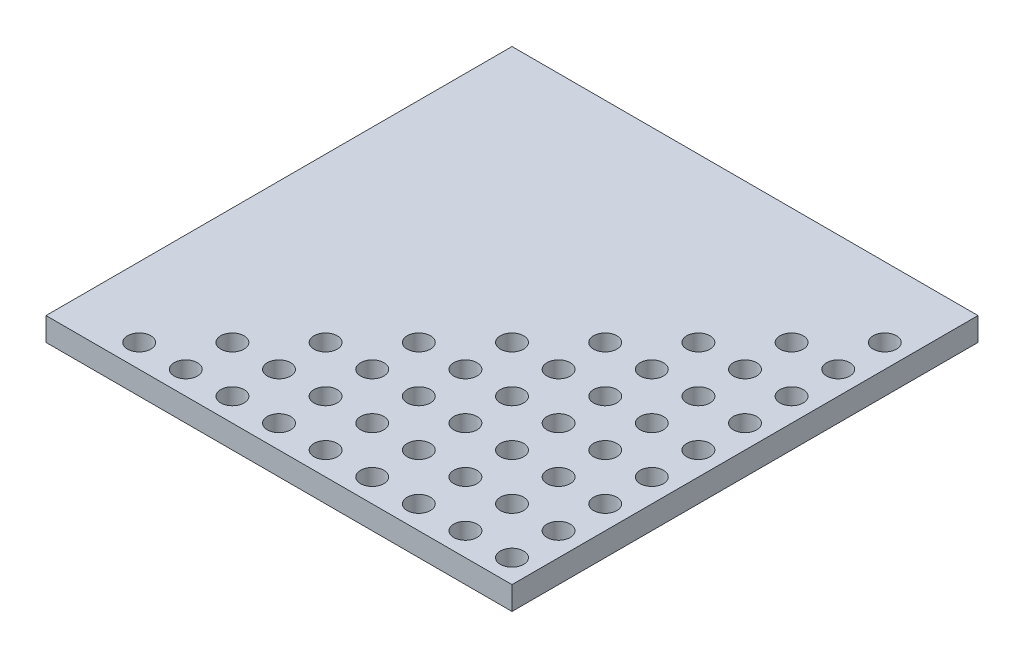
ISO-10303-21;
HEADER;
FILE_DESCRIPTION(('STEP AP214'),'2;1');
FILE_NAME('part.step','',(''),(''),'','','');
FILE_SCHEMA(('AUTOMOTIVE_DESIGN { 1 0 10303 214 1 1 1 1 }'));
ENDSEC;
DATA;
#1=APPLICATION_CONTEXT('core data for automotive mechanical design processes');
#2=APPLICATION_PROTOCOL_DEFINITION('international standard','automotive_design',2000,#1);
#3=PRODUCT_CONTEXT('',#1,'mechanical');
#4=PRODUCT('Part','Part','',(#3));
#5=PRODUCT_RELATED_PRODUCT_CATEGORY('part','',(#4));
#6=PRODUCT_DEFINITION_FORMATION('','',#4);
#7=PRODUCT_DEFINITION_CONTEXT('part definition',#1,'design');
#8=PRODUCT_DEFINITION('design','',#6,#7);
#9=PRODUCT_DEFINITION_SHAPE('','',#8);
#10=(LENGTH_UNIT() NAMED_UNIT(*) SI_UNIT(.MILLI.,.METRE.));
#11=(NAMED_UNIT(*) PLANE_ANGLE_UNIT() SI_UNIT($,.RADIAN.));
#12=(NAMED_UNIT(*) SI_UNIT($,.STERADIAN.) SOLID_ANGLE_UNIT());
#13=UNCERTAINTY_MEASURE_WITH_UNIT(LENGTH_MEASURE(1.E-05),#10,'distance_accuracy_value','');
#14=(GEOMETRIC_REPRESENTATION_CONTEXT(3) GLOBAL_UNCERTAINTY_ASSIGNED_CONTEXT((#13)) GLOBAL_UNIT_ASSIGNED_CONTEXT((#10,
#11,#12)) REPRESENTATION_CONTEXT('',''));
#15=CARTESIAN_POINT('',(0.,0.,0.));
#16=DIRECTION('',(0.,0.,1.));
#17=DIRECTION('',(1.,0.,0.));
#18=AXIS2_PLACEMENT_3D('',#15,#16,#17);
#19=CARTESIAN_POINT('',(0.,5.,-100.));
#20=DIRECTION('',(1.,0.,0.));
#21=DIRECTION('',(0.,0.,-1.));
#22=AXIS2_PLACEMENT_3D('',#19,#20,#21);
#23=PLANE('',#22);
#24=DIRECTION('',(0.,0.,1.));
#25=VECTOR('',#24,1.);
#26=CARTESIAN_POINT('',(0.,0.,-100.));
#27=LINE('',#26,#25);
#28=CARTESIAN_POINT('',(0.,0.,-100.));
#29=VERTEX_POINT('',#28);
#30=CARTESIAN_POINT('',(0.,0.,0.));
#31=VERTEX_POINT('',#30);
#32=EDGE_CURVE('E80',#29,#31,#27,.T.);
#33=ORIENTED_EDGE('',*,*,#32,.T.);
#34=DIRECTION('',(0.,-1.,0.));
#35=VECTOR('',#34,1.);
#36=CARTESIAN_POINT('',(0.,5.,0.));
#37=LINE('',#36,#35);
#38=CARTESIAN_POINT('',(0.,5.,0.));
#39=VERTEX_POINT('',#38);
#40=EDGE_CURVE('E87',#39,#31,#37,.T.);
#41=ORIENTED_EDGE('',*,*,#40,.F.);
#42=DIRECTION('',(0.,0.,1.));
#43=VECTOR('',#42,1.);
#44=CARTESIAN_POINT('',(0.,5.,-100.));
#45=LINE('',#44,#43);
#46=CARTESIAN_POINT('',(0.,5.,-100.));
#47=VERTEX_POINT('',#46);
#48=EDGE_CURVE('E107',#47,#39,#45,.T.);
#49=ORIENTED_EDGE('',*,*,#48,.F.);
#50=DIRECTION('',(0.,-1.,0.));
#51=VECTOR('',#50,1.);
#52=CARTESIAN_POINT('',(0.,5.,-100.));
#53=LINE('',#52,#51);
#54=EDGE_CURVE('E96',#47,#29,#53,.T.);
#55=ORIENTED_EDGE('',*,*,#54,.T.);
#56=EDGE_LOOP('',(#33,#41,#49,#55));
#57=FACE_BOUND('',#56,.T.);
#58=ADVANCED_FACE('F33',(#57),#23,.F.);
#59=CARTESIAN_POINT('',(0.,5.,0.));
#60=DIRECTION('',(0.,0.,-1.));
#61=DIRECTION('',(-1.,0.,0.));
#62=AXIS2_PLACEMENT_3D('',#59,#60,#61);
#63=PLANE('',#62);
#64=DIRECTION('',(1.,0.,0.));
#65=VECTOR('',#64,1.);
#66=CARTESIAN_POINT('',(0.,0.,0.));
#67=LINE('',#66,#65);
#68=CARTESIAN_POINT('',(100.,0.,0.));
#69=VERTEX_POINT('',#68);
#70=EDGE_CURVE('E74',#31,#69,#67,.T.);
#71=ORIENTED_EDGE('',*,*,#70,.T.);
#72=DIRECTION('',(0.,-1.,0.));
#73=VECTOR('',#72,1.);
#74=CARTESIAN_POINT('',(100.,5.,0.));
#75=LINE('',#74,#73);
#76=CARTESIAN_POINT('',(100.,5.,0.));
#77=VERTEX_POINT('',#76);
#78=EDGE_CURVE('E93',#77,#69,#75,.T.);
#79=ORIENTED_EDGE('',*,*,#78,.F.);
#80=DIRECTION('',(1.,0.,0.));
#81=VECTOR('',#80,1.);
#82=CARTESIAN_POINT('',(0.,5.,0.));
#83=LINE('',#82,#81);
#84=EDGE_CURVE('E89',#39,#77,#83,.T.);
#85=ORIENTED_EDGE('',*,*,#84,.F.);
#86=ORIENTED_EDGE('',*,*,#40,.T.);
#87=EDGE_LOOP('',(#71,#79,#85,#86));
#88=FACE_BOUND('',#87,.T.);
#89=ADVANCED_FACE('F88',(#88),#63,.F.);
#90=CARTESIAN_POINT('',(100.,5.,0.));
#91=DIRECTION('',(-1.,0.,0.));
#92=DIRECTION('',(0.,0.,1.));
#93=AXIS2_PLACEMENT_3D('',#90,#91,#92);
#94=PLANE('',#93);
#95=DIRECTION('',(0.,0.,-1.));
#96=VECTOR('',#95,1.);
#97=CARTESIAN_POINT('',(100.,0.,0.));
#98=LINE('',#97,#96);
#99=CARTESIAN_POINT('',(100.,0.,-100.));
#100=VERTEX_POINT('',#99);
#101=EDGE_CURVE('E81',#69,#100,#98,.T.);
#102=ORIENTED_EDGE('',*,*,#101,.T.);
#103=DIRECTION('',(0.,-1.,0.));
#104=VECTOR('',#103,1.);
#105=CARTESIAN_POINT('',(100.,5.,-100.));
#106=LINE('',#105,#104);
#107=CARTESIAN_POINT('',(100.,5.,-100.));
#108=VERTEX_POINT('',#107);
#109=EDGE_CURVE('E113',#108,#100,#106,.T.);
#110=ORIENTED_EDGE('',*,*,#109,.F.);
#111=DIRECTION('',(0.,0.,-1.));
#112=VECTOR('',#111,1.);
#113=CARTESIAN_POINT('',(100.,5.,0.));
#114=LINE('',#113,#112);
#115=EDGE_CURVE('E53',#77,#108,#114,.T.);
#116=ORIENTED_EDGE('',*,*,#115,.F.);
#117=ORIENTED_EDGE('',*,*,#78,.T.);
#118=EDGE_LOOP('',(#102,#110,#116,#117));
#119=FACE_BOUND('',#118,.T.);
#120=ADVANCED_FACE('F388',(#119),#94,.F.);
#121=CARTESIAN_POINT('',(100.,5.,-100.));
#122=DIRECTION('',(0.,0.,1.));
#123=DIRECTION('',(1.,0.,0.));
#124=AXIS2_PLACEMENT_3D('',#121,#122,#123);
#125=PLANE('',#124);
#126=DIRECTION('',(-1.,0.,0.));
#127=VECTOR('',#126,1.);
#128=CARTESIAN_POINT('',(100.,0.,-100.));
#129=LINE('',#128,#127);
#130=EDGE_CURVE('E105',#100,#29,#129,.T.);
#131=ORIENTED_EDGE('',*,*,#130,.T.);
#132=ORIENTED_EDGE('',*,*,#54,.F.);
#133=DIRECTION('',(-1.,0.,0.));
#134=VECTOR('',#133,1.);
#135=CARTESIAN_POINT('',(100.,5.,-100.));
#136=LINE('',#135,#134);
#137=EDGE_CURVE('E48',#108,#47,#136,.T.);
#138=ORIENTED_EDGE('',*,*,#137,.F.);
#139=ORIENTED_EDGE('',*,*,#109,.T.);
#140=EDGE_LOOP('',(#131,#132,#138,#139));
#141=FACE_BOUND('',#140,.T.);
#142=ADVANCED_FACE('F378',(#141),#125,.F.);
#143=CARTESIAN_POINT('',(0.,5.,0.));
#144=DIRECTION('',(0.,1.,0.));
#145=DIRECTION('',(0.,0.,1.));
#146=AXIS2_PLACEMENT_3D('',#143,#144,#145);
#147=PLANE('',#146);
#148=CARTESIAN_POINT('',(85.,5.,-15.));
#149=DIRECTION('',(0.,1.,0.));
#150=DIRECTION('',(0.,0.,1.));
#151=AXIS2_PLACEMENT_3D('',#148,#149,#150);
#152=CIRCLE('',#151,2.5);
#153=CARTESIAN_POINT('',(85.,5.,-12.5));
#154=VERTEX_POINT('',#153);
#155=EDGE_CURVE('E1009',#154,#154,#152,.T.);
#156=ORIENTED_EDGE('',*,*,#155,.F.);
#157=EDGE_LOOP('',(#156));
#158=FACE_BOUND('',#157,.T.);
#159=CARTESIAN_POINT('',(95.,5.,-5.));
#160=DIRECTION('',(0.,1.,0.));
#161=DIRECTION('',(0.,0.,1.));
#162=AXIS2_PLACEMENT_3D('',#159,#160,#161);
#163=CIRCLE('',#162,2.5);
#164=CARTESIAN_POINT('',(95.,5.,-2.5));
#165=VERTEX_POINT('',#164);
#166=EDGE_CURVE('E100',#165,#165,#163,.T.);
#167=ORIENTED_EDGE('',*,*,#166,.F.);
#168=EDGE_LOOP('',(#167));
#169=FACE_BOUND('',#168,.T.);
#170=ORIENTED_EDGE('',*,*,#48,.T.);
#171=ORIENTED_EDGE('',*,*,#84,.T.);
#172=ORIENTED_EDGE('',*,*,#115,.T.);
#173=ORIENTED_EDGE('',*,*,#137,.T.);
#174=EDGE_LOOP('',(#170,#171,#172,#173));
#175=FACE_BOUND('',#174,.T.);
#176=CARTESIAN_POINT('',(75.,5.,-25.));
#177=DIRECTION('',(0.,1.,0.));
#178=DIRECTION('',(0.,0.,1.));
#179=AXIS2_PLACEMENT_3D('',#176,#177,#178);
#180=CIRCLE('',#179,2.5);
#181=CARTESIAN_POINT('',(75.,5.,-22.5));
#182=VERTEX_POINT('',#181);
#183=EDGE_CURVE('E119',#182,#182,#180,.T.);
#184=ORIENTED_EDGE('',*,*,#183,.F.);
#185=EDGE_LOOP('',(#184));
#186=FACE_BOUND('',#185,.T.);
#187=CARTESIAN_POINT('',(64.9999999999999,5.,-34.9999999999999));
#188=DIRECTION('',(0.,1.,0.));
#189=DIRECTION('',(0.,0.,1.));
#190=AXIS2_PLACEMENT_3D('',#187,#188,#189);
#191=CIRCLE('',#190,2.5);
#192=CARTESIAN_POINT('',(64.9999999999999,5.,-32.4999999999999));
#193=VERTEX_POINT('',#192);
#194=EDGE_CURVE('E125',#193,#193,#191,.T.);
#195=ORIENTED_EDGE('',*,*,#194,.F.);
#196=EDGE_LOOP('',(#195));
#197=FACE_BOUND('',#196,.T.);
#198=CARTESIAN_POINT('',(54.9999999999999,5.,-44.9999999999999));
#199=DIRECTION('',(0.,1.,0.));
#200=DIRECTION('',(0.,0.,1.));
#201=AXIS2_PLACEMENT_3D('',#198,#199,#200);
#202=CIRCLE('',#201,2.5);
#203=CARTESIAN_POINT('',(54.9999999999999,5.,-42.4999999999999));
#204=VERTEX_POINT('',#203);
#205=EDGE_CURVE('E131',#204,#204,#202,.T.);
#206=ORIENTED_EDGE('',*,*,#205,.F.);
#207=EDGE_LOOP('',(#206));
#208=FACE_BOUND('',#207,.T.);
#209=CARTESIAN_POINT('',(95.,5.,-15.));
#210=DIRECTION('',(0.,1.,0.));
#211=DIRECTION('',(0.,0.,1.));
#212=AXIS2_PLACEMENT_3D('',#209,#210,#211);
#213=CIRCLE('',#212,2.5);
#214=CARTESIAN_POINT('',(95.,5.,-12.5));
#215=VERTEX_POINT('',#214);
#216=EDGE_CURVE('E137',#215,#215,#213,.T.);
#217=ORIENTED_EDGE('',*,*,#216,.F.);
#218=EDGE_LOOP('',(#217));
#219=FACE_BOUND('',#218,.T.);
#220=CARTESIAN_POINT('',(85.,5.,-25.));
#221=DIRECTION('',(0.,1.,0.));
#222=DIRECTION('',(0.,0.,1.));
#223=AXIS2_PLACEMENT_3D('',#220,#221,#222);
#224=CIRCLE('',#223,2.5);
#225=CARTESIAN_POINT('',(85.,5.,-22.5));
#226=VERTEX_POINT('',#225);
#227=EDGE_CURVE('E143',#226,#226,#224,.T.);
#228=ORIENTED_EDGE('',*,*,#227,.F.);
#229=EDGE_LOOP('',(#228));
#230=FACE_BOUND('',#229,.T.);
#231=CARTESIAN_POINT('',(74.9999999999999,5.,-35.));
#232=DIRECTION('',(0.,1.,0.));
#233=DIRECTION('',(0.,0.,1.));
#234=AXIS2_PLACEMENT_3D('',#231,#232,#233);
#235=CIRCLE('',#234,2.5);
#236=CARTESIAN_POINT('',(74.9999999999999,5.,-32.5));
#237=VERTEX_POINT('',#236);
#238=EDGE_CURVE('E149',#237,#237,#235,.T.);
#239=ORIENTED_EDGE('',*,*,#238,.F.);
#240=EDGE_LOOP('',(#239));
#241=FACE_BOUND('',#240,.T.);
#242=CARTESIAN_POINT('',(64.9999999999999,5.,-44.9999999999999));
#243=DIRECTION('',(0.,1.,0.));
#244=DIRECTION('',(0.,0.,1.));
#245=AXIS2_PLACEMENT_3D('',#242,#243,#244);
#246=CIRCLE('',#245,2.5);
#247=CARTESIAN_POINT('',(64.9999999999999,5.,-42.5));
#248=VERTEX_POINT('',#247);
#249=EDGE_CURVE('E155',#248,#248,#246,.T.);
#250=ORIENTED_EDGE('',*,*,#249,.F.);
#251=EDGE_LOOP('',(#250));
#252=FACE_BOUND('',#251,.T.);
#253=CARTESIAN_POINT('',(95.,5.,-25.));
#254=DIRECTION('',(0.,1.,0.));
#255=DIRECTION('',(0.,0.,1.));
#256=AXIS2_PLACEMENT_3D('',#253,#254,#255);
#257=CIRCLE('',#256,2.5);
#258=CARTESIAN_POINT('',(95.,5.,-22.5));
#259=VERTEX_POINT('',#258);
#260=EDGE_CURVE('E161',#259,#259,#257,.T.);
#261=ORIENTED_EDGE('',*,*,#260,.F.);
#262=EDGE_LOOP('',(#261));
#263=FACE_BOUND('',#262,.T.);
#264=CARTESIAN_POINT('',(84.9999999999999,5.,-35.));
#265=DIRECTION('',(0.,1.,0.));
#266=DIRECTION('',(0.,0.,1.));
#267=AXIS2_PLACEMENT_3D('',#264,#265,#266);
#268=CIRCLE('',#267,2.5);
#269=CARTESIAN_POINT('',(84.9999999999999,5.,-32.5));
#270=VERTEX_POINT('',#269);
#271=EDGE_CURVE('E167',#270,#270,#268,.T.);
#272=ORIENTED_EDGE('',*,*,#271,.F.);
#273=EDGE_LOOP('',(#272));
#274=FACE_BOUND('',#273,.T.);
#275=CARTESIAN_POINT('',(74.9999999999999,5.,-45.));
#276=DIRECTION('',(0.,1.,0.));
#277=DIRECTION('',(0.,0.,1.));
#278=AXIS2_PLACEMENT_3D('',#275,#276,#277);
#279=CIRCLE('',#278,2.5);
#280=CARTESIAN_POINT('',(74.9999999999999,5.,-42.5));
#281=VERTEX_POINT('',#280);
#282=EDGE_CURVE('E173',#281,#281,#279,.T.);
#283=ORIENTED_EDGE('',*,*,#282,.F.);
#284=EDGE_LOOP('',(#283));
#285=FACE_BOUND('',#284,.T.);
#286=CARTESIAN_POINT('',(64.9999999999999,5.,-55.));
#287=DIRECTION('',(0.,1.,0.));
#288=DIRECTION('',(0.,0.,1.));
#289=AXIS2_PLACEMENT_3D('',#286,#287,#288);
#290=CIRCLE('',#289,2.5);
#291=CARTESIAN_POINT('',(64.9999999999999,5.,-52.5));
#292=VERTEX_POINT('',#291);
#293=EDGE_CURVE('E179',#292,#292,#290,.T.);
#294=ORIENTED_EDGE('',*,*,#293,.F.);
#295=EDGE_LOOP('',(#294));
#296=FACE_BOUND('',#295,.T.);
#297=CARTESIAN_POINT('',(94.9999999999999,5.,-35.));
#298=DIRECTION('',(0.,1.,0.));
#299=DIRECTION('',(0.,0.,1.));
#300=AXIS2_PLACEMENT_3D('',#297,#298,#299);
#301=CIRCLE('',#300,2.5);
#302=CARTESIAN_POINT('',(94.9999999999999,5.,-32.5));
#303=VERTEX_POINT('',#302);
#304=EDGE_CURVE('E185',#303,#303,#301,.T.);
#305=ORIENTED_EDGE('',*,*,#304,.F.);
#306=EDGE_LOOP('',(#305));
#307=FACE_BOUND('',#306,.T.);
#308=CARTESIAN_POINT('',(84.9999999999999,5.,-45.));
#309=DIRECTION('',(0.,1.,0.));
#310=DIRECTION('',(0.,0.,1.));
#311=AXIS2_PLACEMENT_3D('',#308,#309,#310);
#312=CIRCLE('',#311,2.5);
#313=CARTESIAN_POINT('',(84.9999999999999,5.,-42.5));
#314=VERTEX_POINT('',#313);
#315=EDGE_CURVE('E191',#314,#314,#312,.T.);
#316=ORIENTED_EDGE('',*,*,#315,.F.);
#317=EDGE_LOOP('',(#316));
#318=FACE_BOUND('',#317,.T.);
#319=CARTESIAN_POINT('',(74.9999999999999,5.,-55.));
#320=DIRECTION('',(0.,1.,0.));
#321=DIRECTION('',(0.,0.,1.));
#322=AXIS2_PLACEMENT_3D('',#319,#320,#321);
#323=CIRCLE('',#322,2.5);
#324=CARTESIAN_POINT('',(74.9999999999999,5.,-52.5));
#325=VERTEX_POINT('',#324);
#326=EDGE_CURVE('E197',#325,#325,#323,.T.);
#327=ORIENTED_EDGE('',*,*,#326,.F.);
#328=EDGE_LOOP('',(#327));
#329=FACE_BOUND('',#328,.T.);
#330=CARTESIAN_POINT('',(94.9999999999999,5.,-45.));
#331=DIRECTION('',(0.,1.,0.));
#332=DIRECTION('',(0.,0.,1.));
#333=AXIS2_PLACEMENT_3D('',#330,#331,#332);
#334=CIRCLE('',#333,2.5);
#335=CARTESIAN_POINT('',(94.9999999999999,5.,-42.5));
#336=VERTEX_POINT('',#335);
#337=EDGE_CURVE('E203',#336,#336,#334,.T.);
#338=ORIENTED_EDGE('',*,*,#337,.F.);
#339=EDGE_LOOP('',(#338));
#340=FACE_BOUND('',#339,.T.);
#341=CARTESIAN_POINT('',(84.9999999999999,5.,-55.));
#342=DIRECTION('',(0.,1.,0.));
#343=DIRECTION('',(0.,0.,1.));
#344=AXIS2_PLACEMENT_3D('',#341,#342,#343);
#345=CIRCLE('',#344,2.5);
#346=CARTESIAN_POINT('',(84.9999999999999,5.,-52.5));
#347=VERTEX_POINT('',#346);
#348=EDGE_CURVE('E209',#347,#347,#345,.T.);
#349=ORIENTED_EDGE('',*,*,#348,.F.);
#350=EDGE_LOOP('',(#349));
#351=FACE_BOUND('',#350,.T.);
#352=CARTESIAN_POINT('',(74.9999999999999,5.,-64.9999999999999));
#353=DIRECTION('',(0.,1.,0.));
#354=DIRECTION('',(0.,0.,1.));
#355=AXIS2_PLACEMENT_3D('',#352,#353,#354);
#356=CIRCLE('',#355,2.5);
#357=CARTESIAN_POINT('',(74.9999999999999,5.,-62.5));
#358=VERTEX_POINT('',#357);
#359=EDGE_CURVE('E215',#358,#358,#356,.T.);
#360=ORIENTED_EDGE('',*,*,#359,.F.);
#361=EDGE_LOOP('',(#360));
#362=FACE_BOUND('',#361,.T.);
#363=CARTESIAN_POINT('',(94.9999999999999,5.,-55.));
#364=DIRECTION('',(0.,1.,0.));
#365=DIRECTION('',(0.,0.,1.));
#366=AXIS2_PLACEMENT_3D('',#363,#364,#365);
#367=CIRCLE('',#366,2.5);
#368=CARTESIAN_POINT('',(94.9999999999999,5.,-52.5));
#369=VERTEX_POINT('',#368);
#370=EDGE_CURVE('E221',#369,#369,#367,.T.);
#371=ORIENTED_EDGE('',*,*,#370,.F.);
#372=EDGE_LOOP('',(#371));
#373=FACE_BOUND('',#372,.T.);
#374=CARTESIAN_POINT('',(84.9999999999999,5.,-65.));
#375=DIRECTION('',(0.,1.,0.));
#376=DIRECTION('',(0.,0.,1.));
#377=AXIS2_PLACEMENT_3D('',#374,#375,#376);
#378=CIRCLE('',#377,2.5);
#379=CARTESIAN_POINT('',(84.9999999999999,5.,-62.5));
#380=VERTEX_POINT('',#379);
#381=EDGE_CURVE('E227',#380,#380,#378,.T.);
#382=ORIENTED_EDGE('',*,*,#381,.F.);
#383=EDGE_LOOP('',(#382));
#384=FACE_BOUND('',#383,.T.);
#385=CARTESIAN_POINT('',(94.9999999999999,5.,-65.));
#386=DIRECTION('',(0.,1.,0.));
#387=DIRECTION('',(0.,0.,1.));
#388=AXIS2_PLACEMENT_3D('',#385,#386,#387);
#389=CIRCLE('',#388,2.5);
#390=CARTESIAN_POINT('',(94.9999999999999,5.,-62.5));
#391=VERTEX_POINT('',#390);
#392=EDGE_CURVE('E233',#391,#391,#389,.T.);
#393=ORIENTED_EDGE('',*,*,#392,.F.);
#394=EDGE_LOOP('',(#393));
#395=FACE_BOUND('',#394,.T.);
#396=CARTESIAN_POINT('',(84.9999999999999,5.,-75.));
#397=DIRECTION('',(0.,1.,0.));
#398=DIRECTION('',(0.,0.,1.));
#399=AXIS2_PLACEMENT_3D('',#396,#397,#398);
#400=CIRCLE('',#399,2.5);
#401=CARTESIAN_POINT('',(84.9999999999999,5.,-72.5));
#402=VERTEX_POINT('',#401);
#403=EDGE_CURVE('E239',#402,#402,#400,.T.);
#404=ORIENTED_EDGE('',*,*,#403,.F.);
#405=EDGE_LOOP('',(#404));
#406=FACE_BOUND('',#405,.T.);
#407=CARTESIAN_POINT('',(85.,5.,-4.99999999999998));
#408=DIRECTION('',(0.,1.,0.));
#409=DIRECTION('',(0.,0.,1.));
#410=AXIS2_PLACEMENT_3D('',#407,#408,#409);
#411=CIRCLE('',#410,2.5);
#412=CARTESIAN_POINT('',(85.,5.,-2.49999999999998));
#413=VERTEX_POINT('',#412);
#414=EDGE_CURVE('E245',#413,#413,#411,.T.);
#415=ORIENTED_EDGE('',*,*,#414,.F.);
#416=EDGE_LOOP('',(#415));
#417=FACE_BOUND('',#416,.T.);
#418=CARTESIAN_POINT('',(94.9999999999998,5.,-75.));
#419=DIRECTION('',(0.,1.,0.));
#420=DIRECTION('',(0.,0.,1.));
#421=AXIS2_PLACEMENT_3D('',#418,#419,#420);
#422=CIRCLE('',#421,2.5);
#423=CARTESIAN_POINT('',(94.9999999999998,5.,-72.5));
#424=VERTEX_POINT('',#423);
#425=EDGE_CURVE('E251',#424,#424,#422,.T.);
#426=ORIENTED_EDGE('',*,*,#425,.F.);
#427=EDGE_LOOP('',(#426));
#428=FACE_BOUND('',#427,.T.);
#429=CARTESIAN_POINT('',(94.9999999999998,5.,-85.));
#430=DIRECTION('',(0.,1.,0.));
#431=DIRECTION('',(0.,0.,1.));
#432=AXIS2_PLACEMENT_3D('',#429,#430,#431);
#433=CIRCLE('',#432,2.5);
#434=CARTESIAN_POINT('',(94.9999999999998,5.,-82.5));
#435=VERTEX_POINT('',#434);
#436=EDGE_CURVE('E257',#435,#435,#433,.T.);
#437=ORIENTED_EDGE('',*,*,#436,.F.);
#438=EDGE_LOOP('',(#437));
#439=FACE_BOUND('',#438,.T.);
#440=CARTESIAN_POINT('',(75.,5.,-4.99999999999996));
#441=DIRECTION('',(0.,1.,0.));
#442=DIRECTION('',(0.,0.,1.));
#443=AXIS2_PLACEMENT_3D('',#440,#441,#442);
#444=CIRCLE('',#443,2.5);
#445=CARTESIAN_POINT('',(75.,5.,-2.49999999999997));
#446=VERTEX_POINT('',#445);
#447=EDGE_CURVE('E263',#446,#446,#444,.T.);
#448=ORIENTED_EDGE('',*,*,#447,.F.);
#449=EDGE_LOOP('',(#448));
#450=FACE_BOUND('',#449,.T.);
#451=CARTESIAN_POINT('',(75.,5.,-15.));
#452=DIRECTION('',(0.,1.,0.));
#453=DIRECTION('',(0.,0.,1.));
#454=AXIS2_PLACEMENT_3D('',#451,#452,#453);
#455=CIRCLE('',#454,2.5);
#456=CARTESIAN_POINT('',(75.,5.,-12.5));
#457=VERTEX_POINT('',#456);
#458=EDGE_CURVE('E269',#457,#457,#455,.T.);
#459=ORIENTED_EDGE('',*,*,#458,.F.);
#460=EDGE_LOOP('',(#459));
#461=FACE_BOUND('',#460,.T.);
#462=CARTESIAN_POINT('',(64.9999999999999,5.,-4.99999999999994));
#463=DIRECTION('',(0.,1.,0.));
#464=DIRECTION('',(0.,0.,1.));
#465=AXIS2_PLACEMENT_3D('',#462,#463,#464);
#466=CIRCLE('',#465,2.5);
#467=CARTESIAN_POINT('',(64.9999999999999,5.,-2.49999999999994));
#468=VERTEX_POINT('',#467);
#469=EDGE_CURVE('E275',#468,#468,#466,.T.);
#470=ORIENTED_EDGE('',*,*,#469,.F.);
#471=EDGE_LOOP('',(#470));
#472=FACE_BOUND('',#471,.T.);
#473=CARTESIAN_POINT('',(64.9999999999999,5.,-14.9999999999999));
#474=DIRECTION('',(0.,1.,0.));
#475=DIRECTION('',(0.,0.,1.));
#476=AXIS2_PLACEMENT_3D('',#473,#474,#475);
#477=CIRCLE('',#476,2.5);
#478=CARTESIAN_POINT('',(64.9999999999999,5.,-12.4999999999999));
#479=VERTEX_POINT('',#478);
#480=EDGE_CURVE('E281',#479,#479,#477,.T.);
#481=ORIENTED_EDGE('',*,*,#480,.F.);
#482=EDGE_LOOP('',(#481));
#483=FACE_BOUND('',#482,.T.);
#484=CARTESIAN_POINT('',(64.9999999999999,5.,-24.9999999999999));
#485=DIRECTION('',(0.,1.,0.));
#486=DIRECTION('',(0.,0.,1.));
#487=AXIS2_PLACEMENT_3D('',#484,#485,#486);
#488=CIRCLE('',#487,2.5);
#489=CARTESIAN_POINT('',(64.9999999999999,5.,-22.4999999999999));
#490=VERTEX_POINT('',#489);
#491=EDGE_CURVE('E287',#490,#490,#488,.T.);
#492=ORIENTED_EDGE('',*,*,#491,.F.);
#493=EDGE_LOOP('',(#492));
#494=FACE_BOUND('',#493,.T.);
#495=CARTESIAN_POINT('',(55.,5.,-4.99999999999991));
#496=DIRECTION('',(0.,1.,0.));
#497=DIRECTION('',(0.,0.,1.));
#498=AXIS2_PLACEMENT_3D('',#495,#496,#497);
#499=CIRCLE('',#498,2.5);
#500=CARTESIAN_POINT('',(55.,5.,-2.49999999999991));
#501=VERTEX_POINT('',#500);
#502=EDGE_CURVE('E293',#501,#501,#499,.T.);
#503=ORIENTED_EDGE('',*,*,#502,.F.);
#504=EDGE_LOOP('',(#503));
#505=FACE_BOUND('',#504,.T.);
#506=CARTESIAN_POINT('',(55.,5.,-14.9999999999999));
#507=DIRECTION('',(0.,1.,0.));
#508=DIRECTION('',(0.,0.,1.));
#509=AXIS2_PLACEMENT_3D('',#506,#507,#508);
#510=CIRCLE('',#509,2.5);
#511=CARTESIAN_POINT('',(55.,5.,-12.4999999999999));
#512=VERTEX_POINT('',#511);
#513=EDGE_CURVE('E299',#512,#512,#510,.T.);
#514=ORIENTED_EDGE('',*,*,#513,.F.);
#515=EDGE_LOOP('',(#514));
#516=FACE_BOUND('',#515,.T.);
#517=CARTESIAN_POINT('',(55.,5.,-24.9999999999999));
#518=DIRECTION('',(0.,1.,0.));
#519=DIRECTION('',(0.,0.,1.));
#520=AXIS2_PLACEMENT_3D('',#517,#518,#519);
#521=CIRCLE('',#520,2.5);
#522=CARTESIAN_POINT('',(55.,5.,-22.4999999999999));
#523=VERTEX_POINT('',#522);
#524=EDGE_CURVE('E305',#523,#523,#521,.T.);
#525=ORIENTED_EDGE('',*,*,#524,.F.);
#526=EDGE_LOOP('',(#525));
#527=FACE_BOUND('',#526,.T.);
#528=CARTESIAN_POINT('',(55.,5.,-34.9999999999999));
#529=DIRECTION('',(0.,1.,0.));
#530=DIRECTION('',(0.,0.,1.));
#531=AXIS2_PLACEMENT_3D('',#528,#529,#530);
#532=CIRCLE('',#531,2.5);
#533=CARTESIAN_POINT('',(55.,5.,-32.4999999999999));
#534=VERTEX_POINT('',#533);
#535=EDGE_CURVE('E311',#534,#534,#532,.T.);
#536=ORIENTED_EDGE('',*,*,#535,.F.);
#537=EDGE_LOOP('',(#536));
#538=FACE_BOUND('',#537,.T.);
#539=CARTESIAN_POINT('',(45.,5.,-4.99999999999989));
#540=DIRECTION('',(0.,1.,0.));
#541=DIRECTION('',(0.,0.,1.));
#542=AXIS2_PLACEMENT_3D('',#539,#540,#541);
#543=CIRCLE('',#542,2.5);
#544=CARTESIAN_POINT('',(45.,5.,-2.49999999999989));
#545=VERTEX_POINT('',#544);
#546=EDGE_CURVE('E317',#545,#545,#543,.T.);
#547=ORIENTED_EDGE('',*,*,#546,.F.);
#548=EDGE_LOOP('',(#547));
#549=FACE_BOUND('',#548,.T.);
#550=CARTESIAN_POINT('',(45.,5.,-14.9999999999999));
#551=DIRECTION('',(0.,1.,0.));
#552=DIRECTION('',(0.,0.,1.));
#553=AXIS2_PLACEMENT_3D('',#550,#551,#552);
#554=CIRCLE('',#553,2.5);
#555=CARTESIAN_POINT('',(45.,5.,-12.4999999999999));
#556=VERTEX_POINT('',#555);
#557=EDGE_CURVE('E323',#556,#556,#554,.T.);
#558=ORIENTED_EDGE('',*,*,#557,.F.);
#559=EDGE_LOOP('',(#558));
#560=FACE_BOUND('',#559,.T.);
#561=CARTESIAN_POINT('',(45.,5.,-24.9999999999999));
#562=DIRECTION('',(0.,1.,0.));
#563=DIRECTION('',(0.,0.,1.));
#564=AXIS2_PLACEMENT_3D('',#561,#562,#563);
#565=CIRCLE('',#564,2.5);
#566=CARTESIAN_POINT('',(45.,5.,-22.4999999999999));
#567=VERTEX_POINT('',#566);
#568=EDGE_CURVE('E329',#567,#567,#565,.T.);
#569=ORIENTED_EDGE('',*,*,#568,.F.);
#570=EDGE_LOOP('',(#569));
#571=FACE_BOUND('',#570,.T.);
#572=CARTESIAN_POINT('',(45.,5.,-34.9999999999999));
#573=DIRECTION('',(0.,1.,0.));
#574=DIRECTION('',(0.,0.,1.));
#575=AXIS2_PLACEMENT_3D('',#572,#573,#574);
#576=CIRCLE('',#575,2.5);
#577=CARTESIAN_POINT('',(45.,5.,-32.4999999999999));
#578=VERTEX_POINT('',#577);
#579=EDGE_CURVE('E335',#578,#578,#576,.T.);
#580=ORIENTED_EDGE('',*,*,#579,.F.);
#581=EDGE_LOOP('',(#580));
#582=FACE_BOUND('',#581,.T.);
#583=CARTESIAN_POINT('',(35.,5.,-4.99999999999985));
#584=DIRECTION('',(0.,1.,0.));
#585=DIRECTION('',(0.,0.,1.));
#586=AXIS2_PLACEMENT_3D('',#583,#584,#585);
#587=CIRCLE('',#586,2.5);
#588=CARTESIAN_POINT('',(35.,5.,-2.49999999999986));
#589=VERTEX_POINT('',#588);
#590=EDGE_CURVE('E341',#589,#589,#587,.T.);
#591=ORIENTED_EDGE('',*,*,#590,.F.);
#592=EDGE_LOOP('',(#591));
#593=FACE_BOUND('',#592,.T.);
#594=CARTESIAN_POINT('',(35.,5.,-14.9999999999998));
#595=DIRECTION('',(0.,1.,0.));
#596=DIRECTION('',(0.,0.,1.));
#597=AXIS2_PLACEMENT_3D('',#594,#595,#596);
#598=CIRCLE('',#597,2.5);
#599=CARTESIAN_POINT('',(35.,5.,-12.4999999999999));
#600=VERTEX_POINT('',#599);
#601=EDGE_CURVE('E347',#600,#600,#598,.T.);
#602=ORIENTED_EDGE('',*,*,#601,.F.);
#603=EDGE_LOOP('',(#602));
#604=FACE_BOUND('',#603,.T.);
#605=CARTESIAN_POINT('',(35.,5.,-24.9999999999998));
#606=DIRECTION('',(0.,1.,0.));
#607=DIRECTION('',(0.,0.,1.));
#608=AXIS2_PLACEMENT_3D('',#605,#606,#607);
#609=CIRCLE('',#608,2.5);
#610=CARTESIAN_POINT('',(35.,5.,-22.4999999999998));
#611=VERTEX_POINT('',#610);
#612=EDGE_CURVE('E353',#611,#611,#609,.T.);
#613=ORIENTED_EDGE('',*,*,#612,.F.);
#614=EDGE_LOOP('',(#613));
#615=FACE_BOUND('',#614,.T.);
#616=CARTESIAN_POINT('',(25.,5.,-4.99999999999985));
#617=DIRECTION('',(0.,1.,0.));
#618=DIRECTION('',(0.,0.,1.));
#619=AXIS2_PLACEMENT_3D('',#616,#617,#618);
#620=CIRCLE('',#619,2.5);
#621=CARTESIAN_POINT('',(25.,5.,-2.49999999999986));
#622=VERTEX_POINT('',#621);
#623=EDGE_CURVE('E359',#622,#622,#620,.T.);
#624=ORIENTED_EDGE('',*,*,#623,.F.);
#625=EDGE_LOOP('',(#624));
#626=FACE_BOUND('',#625,.T.);
#627=CARTESIAN_POINT('',(25.,5.,-14.9999999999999));
#628=DIRECTION('',(0.,1.,0.));
#629=DIRECTION('',(0.,0.,1.));
#630=AXIS2_PLACEMENT_3D('',#627,#628,#629);
#631=CIRCLE('',#630,2.5);
#632=CARTESIAN_POINT('',(25.,5.,-12.4999999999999));
#633=VERTEX_POINT('',#632);
#634=EDGE_CURVE('E365',#633,#633,#631,.T.);
#635=ORIENTED_EDGE('',*,*,#634,.F.);
#636=EDGE_LOOP('',(#635));
#637=FACE_BOUND('',#636,.T.);
#638=CARTESIAN_POINT('',(15.,5.,-4.99999999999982));
#639=DIRECTION('',(0.,1.,0.));
#640=DIRECTION('',(0.,0.,1.));
#641=AXIS2_PLACEMENT_3D('',#638,#639,#640);
#642=CIRCLE('',#641,2.5);
#643=CARTESIAN_POINT('',(15.,5.,-2.49999999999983));
#644=VERTEX_POINT('',#643);
#645=EDGE_CURVE('E11',#644,#644,#642,.T.);
#646=ORIENTED_EDGE('',*,*,#645,.F.);
#647=EDGE_LOOP('',(#646));
#648=FACE_BOUND('',#647,.T.);
#649=ADVANCED_FACE('F376',(#158,#169,#175,#186,#197,#208,#219,#230,#241,#252,#263,#274,#285,
#296,#307,#318,#329,#340,#351,#362,#373,#384,#395,#406,#417,#428,#439,#450,#461,#472,#483,#494,
#505,#516,#527,#538,#549,#560,#571,#582,#593,#604,#615,#626,#637,#648),#147,.T.);
#650=CARTESIAN_POINT('',(0.,0.,0.));
#651=DIRECTION('',(0.,1.,0.));
#652=DIRECTION('',(0.,0.,1.));
#653=AXIS2_PLACEMENT_3D('',#650,#651,#652);
#654=PLANE('',#653);
#655=CARTESIAN_POINT('',(85.,0.,-15.));
#656=DIRECTION('',(0.,1.,0.));
#657=DIRECTION('',(0.,0.,1.));
#658=AXIS2_PLACEMENT_3D('',#655,#656,#657);
#659=CIRCLE('',#658,2.5);
#660=CARTESIAN_POINT('',(85.,0.,-12.5));
#661=VERTEX_POINT('',#660);
#662=EDGE_CURVE('E1011',#661,#661,#659,.T.);
#663=ORIENTED_EDGE('',*,*,#662,.T.);
#664=EDGE_LOOP('',(#663));
#665=FACE_BOUND('',#664,.T.);
#666=CARTESIAN_POINT('',(95.,0.,-5.));
#667=DIRECTION('',(0.,1.,0.));
#668=DIRECTION('',(0.,0.,1.));
#669=AXIS2_PLACEMENT_3D('',#666,#667,#668);
#670=CIRCLE('',#669,2.5);
#671=CARTESIAN_POINT('',(95.,0.,-2.5));
#672=VERTEX_POINT('',#671);
#673=EDGE_CURVE('E97',#672,#672,#670,.T.);
#674=ORIENTED_EDGE('',*,*,#673,.T.);
#675=EDGE_LOOP('',(#674));
#676=FACE_BOUND('',#675,.T.);
#677=ORIENTED_EDGE('',*,*,#32,.F.);
#678=ORIENTED_EDGE('',*,*,#130,.F.);
#679=ORIENTED_EDGE('',*,*,#101,.F.);
#680=ORIENTED_EDGE('',*,*,#70,.F.);
#681=EDGE_LOOP('',(#677,#678,#679,#680));
#682=FACE_BOUND('',#681,.T.);
#683=CARTESIAN_POINT('',(75.,0.,-25.));
#684=DIRECTION('',(0.,1.,0.));
#685=DIRECTION('',(0.,0.,1.));
#686=AXIS2_PLACEMENT_3D('',#683,#684,#685);
#687=CIRCLE('',#686,2.5);
#688=CARTESIAN_POINT('',(75.,0.,-22.5));
#689=VERTEX_POINT('',#688);
#690=EDGE_CURVE('E92',#689,#689,#687,.T.);
#691=ORIENTED_EDGE('',*,*,#690,.T.);
#692=EDGE_LOOP('',(#691));
#693=FACE_BOUND('',#692,.T.);
#694=CARTESIAN_POINT('',(64.9999999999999,0.,-34.9999999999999));
#695=DIRECTION('',(0.,1.,0.));
#696=DIRECTION('',(0.,0.,1.));
#697=AXIS2_PLACEMENT_3D('',#694,#695,#696);
#698=CIRCLE('',#697,2.5);
#699=CARTESIAN_POINT('',(64.9999999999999,0.,-32.4999999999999));
#700=VERTEX_POINT('',#699);
#701=EDGE_CURVE('E122',#700,#700,#698,.T.);
#702=ORIENTED_EDGE('',*,*,#701,.T.);
#703=EDGE_LOOP('',(#702));
#704=FACE_BOUND('',#703,.T.);
#705=CARTESIAN_POINT('',(54.9999999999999,0.,-44.9999999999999));
#706=DIRECTION('',(0.,1.,0.));
#707=DIRECTION('',(0.,0.,1.));
#708=AXIS2_PLACEMENT_3D('',#705,#706,#707);
#709=CIRCLE('',#708,2.5);
#710=CARTESIAN_POINT('',(54.9999999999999,0.,-42.4999999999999));
#711=VERTEX_POINT('',#710);
#712=EDGE_CURVE('E128',#711,#711,#709,.T.);
#713=ORIENTED_EDGE('',*,*,#712,.T.);
#714=EDGE_LOOP('',(#713));
#715=FACE_BOUND('',#714,.T.);
#716=CARTESIAN_POINT('',(95.,0.,-15.));
#717=DIRECTION('',(0.,1.,0.));
#718=DIRECTION('',(0.,0.,1.));
#719=AXIS2_PLACEMENT_3D('',#716,#717,#718);
#720=CIRCLE('',#719,2.5);
#721=CARTESIAN_POINT('',(95.,0.,-12.5));
#722=VERTEX_POINT('',#721);
#723=EDGE_CURVE('E134',#722,#722,#720,.T.);
#724=ORIENTED_EDGE('',*,*,#723,.T.);
#725=EDGE_LOOP('',(#724));
#726=FACE_BOUND('',#725,.T.);
#727=CARTESIAN_POINT('',(85.,0.,-25.));
#728=DIRECTION('',(0.,1.,0.));
#729=DIRECTION('',(0.,0.,1.));
#730=AXIS2_PLACEMENT_3D('',#727,#728,#729);
#731=CIRCLE('',#730,2.5);
#732=CARTESIAN_POINT('',(85.,0.,-22.5));
#733=VERTEX_POINT('',#732);
#734=EDGE_CURVE('E140',#733,#733,#731,.T.);
#735=ORIENTED_EDGE('',*,*,#734,.T.);
#736=EDGE_LOOP('',(#735));
#737=FACE_BOUND('',#736,.T.);
#738=CARTESIAN_POINT('',(74.9999999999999,0.,-35.));
#739=DIRECTION('',(0.,1.,0.));
#740=DIRECTION('',(0.,0.,1.));
#741=AXIS2_PLACEMENT_3D('',#738,#739,#740);
#742=CIRCLE('',#741,2.5);
#743=CARTESIAN_POINT('',(74.9999999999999,0.,-32.5));
#744=VERTEX_POINT('',#743);
#745=EDGE_CURVE('E146',#744,#744,#742,.T.);
#746=ORIENTED_EDGE('',*,*,#745,.T.);
#747=EDGE_LOOP('',(#746));
#748=FACE_BOUND('',#747,.T.);
#749=CARTESIAN_POINT('',(64.9999999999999,0.,-44.9999999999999));
#750=DIRECTION('',(0.,1.,0.));
#751=DIRECTION('',(0.,0.,1.));
#752=AXIS2_PLACEMENT_3D('',#749,#750,#751);
#753=CIRCLE('',#752,2.5);
#754=CARTESIAN_POINT('',(64.9999999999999,0.,-42.5));
#755=VERTEX_POINT('',#754);
#756=EDGE_CURVE('E152',#755,#755,#753,.T.);
#757=ORIENTED_EDGE('',*,*,#756,.T.);
#758=EDGE_LOOP('',(#757));
#759=FACE_BOUND('',#758,.T.);
#760=CARTESIAN_POINT('',(95.,0.,-25.));
#761=DIRECTION('',(0.,1.,0.));
#762=DIRECTION('',(0.,0.,1.));
#763=AXIS2_PLACEMENT_3D('',#760,#761,#762);
#764=CIRCLE('',#763,2.5);
#765=CARTESIAN_POINT('',(95.,0.,-22.5));
#766=VERTEX_POINT('',#765);
#767=EDGE_CURVE('E158',#766,#766,#764,.T.);
#768=ORIENTED_EDGE('',*,*,#767,.T.);
#769=EDGE_LOOP('',(#768));
#770=FACE_BOUND('',#769,.T.);
#771=CARTESIAN_POINT('',(84.9999999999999,0.,-35.));
#772=DIRECTION('',(0.,1.,0.));
#773=DIRECTION('',(0.,0.,1.));
#774=AXIS2_PLACEMENT_3D('',#771,#772,#773);
#775=CIRCLE('',#774,2.5);
#776=CARTESIAN_POINT('',(84.9999999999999,0.,-32.5));
#777=VERTEX_POINT('',#776);
#778=EDGE_CURVE('E164',#777,#777,#775,.T.);
#779=ORIENTED_EDGE('',*,*,#778,.T.);
#780=EDGE_LOOP('',(#779));
#781=FACE_BOUND('',#780,.T.);
#782=CARTESIAN_POINT('',(74.9999999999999,0.,-45.));
#783=DIRECTION('',(0.,1.,0.));
#784=DIRECTION('',(0.,0.,1.));
#785=AXIS2_PLACEMENT_3D('',#782,#783,#784);
#786=CIRCLE('',#785,2.5);
#787=CARTESIAN_POINT('',(74.9999999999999,0.,-42.5));
#788=VERTEX_POINT('',#787);
#789=EDGE_CURVE('E170',#788,#788,#786,.T.);
#790=ORIENTED_EDGE('',*,*,#789,.T.);
#791=EDGE_LOOP('',(#790));
#792=FACE_BOUND('',#791,.T.);
#793=CARTESIAN_POINT('',(64.9999999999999,0.,-55.));
#794=DIRECTION('',(0.,1.,0.));
#795=DIRECTION('',(0.,0.,1.));
#796=AXIS2_PLACEMENT_3D('',#793,#794,#795);
#797=CIRCLE('',#796,2.5);
#798=CARTESIAN_POINT('',(64.9999999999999,0.,-52.5));
#799=VERTEX_POINT('',#798);
#800=EDGE_CURVE('E176',#799,#799,#797,.T.);
#801=ORIENTED_EDGE('',*,*,#800,.T.);
#802=EDGE_LOOP('',(#801));
#803=FACE_BOUND('',#802,.T.);
#804=CARTESIAN_POINT('',(94.9999999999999,0.,-35.));
#805=DIRECTION('',(0.,1.,0.));
#806=DIRECTION('',(0.,0.,1.));
#807=AXIS2_PLACEMENT_3D('',#804,#805,#806);
#808=CIRCLE('',#807,2.5);
#809=CARTESIAN_POINT('',(94.9999999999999,0.,-32.5));
#810=VERTEX_POINT('',#809);
#811=EDGE_CURVE('E182',#810,#810,#808,.T.);
#812=ORIENTED_EDGE('',*,*,#811,.T.);
#813=EDGE_LOOP('',(#812));
#814=FACE_BOUND('',#813,.T.);
#815=CARTESIAN_POINT('',(84.9999999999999,0.,-45.));
#816=DIRECTION('',(0.,1.,0.));
#817=DIRECTION('',(0.,0.,1.));
#818=AXIS2_PLACEMENT_3D('',#815,#816,#817);
#819=CIRCLE('',#818,2.5);
#820=CARTESIAN_POINT('',(84.9999999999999,0.,-42.5));
#821=VERTEX_POINT('',#820);
#822=EDGE_CURVE('E188',#821,#821,#819,.T.);
#823=ORIENTED_EDGE('',*,*,#822,.T.);
#824=EDGE_LOOP('',(#823));
#825=FACE_BOUND('',#824,.T.);
#826=CARTESIAN_POINT('',(74.9999999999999,0.,-55.));
#827=DIRECTION('',(0.,1.,0.));
#828=DIRECTION('',(0.,0.,1.));
#829=AXIS2_PLACEMENT_3D('',#826,#827,#828);
#830=CIRCLE('',#829,2.5);
#831=CARTESIAN_POINT('',(74.9999999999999,0.,-52.5));
#832=VERTEX_POINT('',#831);
#833=EDGE_CURVE('E194',#832,#832,#830,.T.);
#834=ORIENTED_EDGE('',*,*,#833,.T.);
#835=EDGE_LOOP('',(#834));
#836=FACE_BOUND('',#835,.T.);
#837=CARTESIAN_POINT('',(94.9999999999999,0.,-45.));
#838=DIRECTION('',(0.,1.,0.));
#839=DIRECTION('',(0.,0.,1.));
#840=AXIS2_PLACEMENT_3D('',#837,#838,#839);
#841=CIRCLE('',#840,2.5);
#842=CARTESIAN_POINT('',(94.9999999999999,0.,-42.5));
#843=VERTEX_POINT('',#842);
#844=EDGE_CURVE('E200',#843,#843,#841,.T.);
#845=ORIENTED_EDGE('',*,*,#844,.T.);
#846=EDGE_LOOP('',(#845));
#847=FACE_BOUND('',#846,.T.);
#848=CARTESIAN_POINT('',(84.9999999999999,0.,-55.));
#849=DIRECTION('',(0.,1.,0.));
#850=DIRECTION('',(0.,0.,1.));
#851=AXIS2_PLACEMENT_3D('',#848,#849,#850);
#852=CIRCLE('',#851,2.5);
#853=CARTESIAN_POINT('',(84.9999999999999,0.,-52.5));
#854=VERTEX_POINT('',#853);
#855=EDGE_CURVE('E206',#854,#854,#852,.T.);
#856=ORIENTED_EDGE('',*,*,#855,.T.);
#857=EDGE_LOOP('',(#856));
#858=FACE_BOUND('',#857,.T.);
#859=CARTESIAN_POINT('',(74.9999999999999,0.,-64.9999999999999));
#860=DIRECTION('',(0.,1.,0.));
#861=DIRECTION('',(0.,0.,1.));
#862=AXIS2_PLACEMENT_3D('',#859,#860,#861);
#863=CIRCLE('',#862,2.5);
#864=CARTESIAN_POINT('',(74.9999999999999,0.,-62.5));
#865=VERTEX_POINT('',#864);
#866=EDGE_CURVE('E212',#865,#865,#863,.T.);
#867=ORIENTED_EDGE('',*,*,#866,.T.);
#868=EDGE_LOOP('',(#867));
#869=FACE_BOUND('',#868,.T.);
#870=CARTESIAN_POINT('',(94.9999999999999,0.,-55.));
#871=DIRECTION('',(0.,1.,0.));
#872=DIRECTION('',(0.,0.,1.));
#873=AXIS2_PLACEMENT_3D('',#870,#871,#872);
#874=CIRCLE('',#873,2.5);
#875=CARTESIAN_POINT('',(94.9999999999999,0.,-52.5));
#876=VERTEX_POINT('',#875);
#877=EDGE_CURVE('E218',#876,#876,#874,.T.);
#878=ORIENTED_EDGE('',*,*,#877,.T.);
#879=EDGE_LOOP('',(#878));
#880=FACE_BOUND('',#879,.T.);
#881=CARTESIAN_POINT('',(84.9999999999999,0.,-65.));
#882=DIRECTION('',(0.,1.,0.));
#883=DIRECTION('',(0.,0.,1.));
#884=AXIS2_PLACEMENT_3D('',#881,#882,#883);
#885=CIRCLE('',#884,2.5);
#886=CARTESIAN_POINT('',(84.9999999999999,0.,-62.5));
#887=VERTEX_POINT('',#886);
#888=EDGE_CURVE('E224',#887,#887,#885,.T.);
#889=ORIENTED_EDGE('',*,*,#888,.T.);
#890=EDGE_LOOP('',(#889));
#891=FACE_BOUND('',#890,.T.);
#892=CARTESIAN_POINT('',(94.9999999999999,0.,-65.));
#893=DIRECTION('',(0.,1.,0.));
#894=DIRECTION('',(0.,0.,1.));
#895=AXIS2_PLACEMENT_3D('',#892,#893,#894);
#896=CIRCLE('',#895,2.5);
#897=CARTESIAN_POINT('',(94.9999999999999,0.,-62.5));
#898=VERTEX_POINT('',#897);
#899=EDGE_CURVE('E230',#898,#898,#896,.T.);
#900=ORIENTED_EDGE('',*,*,#899,.T.);
#901=EDGE_LOOP('',(#900));
#902=FACE_BOUND('',#901,.T.);
#903=CARTESIAN_POINT('',(84.9999999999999,0.,-75.));
#904=DIRECTION('',(0.,1.,0.));
#905=DIRECTION('',(0.,0.,1.));
#906=AXIS2_PLACEMENT_3D('',#903,#904,#905);
#907=CIRCLE('',#906,2.5);
#908=CARTESIAN_POINT('',(84.9999999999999,0.,-72.5));
#909=VERTEX_POINT('',#908);
#910=EDGE_CURVE('E236',#909,#909,#907,.T.);
#911=ORIENTED_EDGE('',*,*,#910,.T.);
#912=EDGE_LOOP('',(#911));
#913=FACE_BOUND('',#912,.T.);
#914=CARTESIAN_POINT('',(85.,0.,-4.99999999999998));
#915=DIRECTION('',(0.,1.,0.));
#916=DIRECTION('',(0.,0.,1.));
#917=AXIS2_PLACEMENT_3D('',#914,#915,#916);
#918=CIRCLE('',#917,2.5);
#919=CARTESIAN_POINT('',(85.,0.,-2.49999999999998));
#920=VERTEX_POINT('',#919);
#921=EDGE_CURVE('E242',#920,#920,#918,.T.);
#922=ORIENTED_EDGE('',*,*,#921,.T.);
#923=EDGE_LOOP('',(#922));
#924=FACE_BOUND('',#923,.T.);
#925=CARTESIAN_POINT('',(94.9999999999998,0.,-75.));
#926=DIRECTION('',(0.,1.,0.));
#927=DIRECTION('',(0.,0.,1.));
#928=AXIS2_PLACEMENT_3D('',#925,#926,#927);
#929=CIRCLE('',#928,2.5);
#930=CARTESIAN_POINT('',(94.9999999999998,0.,-72.5));
#931=VERTEX_POINT('',#930);
#932=EDGE_CURVE('E248',#931,#931,#929,.T.);
#933=ORIENTED_EDGE('',*,*,#932,.T.);
#934=EDGE_LOOP('',(#933));
#935=FACE_BOUND('',#934,.T.);
#936=CARTESIAN_POINT('',(94.9999999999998,0.,-85.));
#937=DIRECTION('',(0.,1.,0.));
#938=DIRECTION('',(0.,0.,1.));
#939=AXIS2_PLACEMENT_3D('',#936,#937,#938);
#940=CIRCLE('',#939,2.5);
#941=CARTESIAN_POINT('',(94.9999999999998,0.,-82.5));
#942=VERTEX_POINT('',#941);
#943=EDGE_CURVE('E254',#942,#942,#940,.T.);
#944=ORIENTED_EDGE('',*,*,#943,.T.);
#945=EDGE_LOOP('',(#944));
#946=FACE_BOUND('',#945,.T.);
#947=CARTESIAN_POINT('',(75.,0.,-4.99999999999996));
#948=DIRECTION('',(0.,1.,0.));
#949=DIRECTION('',(0.,0.,1.));
#950=AXIS2_PLACEMENT_3D('',#947,#948,#949);
#951=CIRCLE('',#950,2.5);
#952=CARTESIAN_POINT('',(75.,0.,-2.49999999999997));
#953=VERTEX_POINT('',#952);
#954=EDGE_CURVE('E260',#953,#953,#951,.T.);
#955=ORIENTED_EDGE('',*,*,#954,.T.);
#956=EDGE_LOOP('',(#955));
#957=FACE_BOUND('',#956,.T.);
#958=CARTESIAN_POINT('',(75.,0.,-15.));
#959=DIRECTION('',(0.,1.,0.));
#960=DIRECTION('',(0.,0.,1.));
#961=AXIS2_PLACEMENT_3D('',#958,#959,#960);
#962=CIRCLE('',#961,2.5);
#963=CARTESIAN_POINT('',(75.,0.,-12.5));
#964=VERTEX_POINT('',#963);
#965=EDGE_CURVE('E266',#964,#964,#962,.T.);
#966=ORIENTED_EDGE('',*,*,#965,.T.);
#967=EDGE_LOOP('',(#966));
#968=FACE_BOUND('',#967,.T.);
#969=CARTESIAN_POINT('',(64.9999999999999,0.,-4.99999999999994));
#970=DIRECTION('',(0.,1.,0.));
#971=DIRECTION('',(0.,0.,1.));
#972=AXIS2_PLACEMENT_3D('',#969,#970,#971);
#973=CIRCLE('',#972,2.5);
#974=CARTESIAN_POINT('',(64.9999999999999,0.,-2.49999999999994));
#975=VERTEX_POINT('',#974);
#976=EDGE_CURVE('E272',#975,#975,#973,.T.);
#977=ORIENTED_EDGE('',*,*,#976,.T.);
#978=EDGE_LOOP('',(#977));
#979=FACE_BOUND('',#978,.T.);
#980=CARTESIAN_POINT('',(64.9999999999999,0.,-14.9999999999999));
#981=DIRECTION('',(0.,1.,0.));
#982=DIRECTION('',(0.,0.,1.));
#983=AXIS2_PLACEMENT_3D('',#980,#981,#982);
#984=CIRCLE('',#983,2.5);
#985=CARTESIAN_POINT('',(64.9999999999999,0.,-12.4999999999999));
#986=VERTEX_POINT('',#985);
#987=EDGE_CURVE('E278',#986,#986,#984,.T.);
#988=ORIENTED_EDGE('',*,*,#987,.T.);
#989=EDGE_LOOP('',(#988));
#990=FACE_BOUND('',#989,.T.);
#991=CARTESIAN_POINT('',(64.9999999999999,0.,-24.9999999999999));
#992=DIRECTION('',(0.,1.,0.));
#993=DIRECTION('',(0.,0.,1.));
#994=AXIS2_PLACEMENT_3D('',#991,#992,#993);
#995=CIRCLE('',#994,2.5);
#996=CARTESIAN_POINT('',(64.9999999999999,0.,-22.4999999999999));
#997=VERTEX_POINT('',#996);
#998=EDGE_CURVE('E284',#997,#997,#995,.T.);
#999=ORIENTED_EDGE('',*,*,#998,.T.);
#1000=EDGE_LOOP('',(#999));
#1001=FACE_BOUND('',#1000,.T.);
#1002=CARTESIAN_POINT('',(55.,0.,-4.99999999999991));
#1003=DIRECTION('',(0.,1.,0.));
#1004=DIRECTION('',(0.,0.,1.));
#1005=AXIS2_PLACEMENT_3D('',#1002,#1003,#1004);
#1006=CIRCLE('',#1005,2.5);
#1007=CARTESIAN_POINT('',(55.,0.,-2.49999999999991));
#1008=VERTEX_POINT('',#1007);
#1009=EDGE_CURVE('E290',#1008,#1008,#1006,.T.);
#1010=ORIENTED_EDGE('',*,*,#1009,.T.);
#1011=EDGE_LOOP('',(#1010));
#1012=FACE_BOUND('',#1011,.T.);
#1013=CARTESIAN_POINT('',(55.,0.,-14.9999999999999));
#1014=DIRECTION('',(0.,1.,0.));
#1015=DIRECTION('',(0.,0.,1.));
#1016=AXIS2_PLACEMENT_3D('',#1013,#1014,#1015);
#1017=CIRCLE('',#1016,2.5);
#1018=CARTESIAN_POINT('',(55.,0.,-12.4999999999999));
#1019=VERTEX_POINT('',#1018);
#1020=EDGE_CURVE('E296',#1019,#1019,#1017,.T.);
#1021=ORIENTED_EDGE('',*,*,#1020,.T.);
#1022=EDGE_LOOP('',(#1021));
#1023=FACE_BOUND('',#1022,.T.);
#1024=CARTESIAN_POINT('',(55.,0.,-24.9999999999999));
#1025=DIRECTION('',(0.,1.,0.));
#1026=DIRECTION('',(0.,0.,1.));
#1027=AXIS2_PLACEMENT_3D('',#1024,#1025,#1026);
#1028=CIRCLE('',#1027,2.5);
#1029=CARTESIAN_POINT('',(55.,0.,-22.4999999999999));
#1030=VERTEX_POINT('',#1029);
#1031=EDGE_CURVE('E302',#1030,#1030,#1028,.T.);
#1032=ORIENTED_EDGE('',*,*,#1031,.T.);
#1033=EDGE_LOOP('',(#1032));
#1034=FACE_BOUND('',#1033,.T.);
#1035=CARTESIAN_POINT('',(55.,0.,-34.9999999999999));
#1036=DIRECTION('',(0.,1.,0.));
#1037=DIRECTION('',(0.,0.,1.));
#1038=AXIS2_PLACEMENT_3D('',#1035,#1036,#1037);
#1039=CIRCLE('',#1038,2.5);
#1040=CARTESIAN_POINT('',(55.,0.,-32.4999999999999));
#1041=VERTEX_POINT('',#1040);
#1042=EDGE_CURVE('E308',#1041,#1041,#1039,.T.);
#1043=ORIENTED_EDGE('',*,*,#1042,.T.);
#1044=EDGE_LOOP('',(#1043));
#1045=FACE_BOUND('',#1044,.T.);
#1046=CARTESIAN_POINT('',(45.,0.,-4.99999999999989));
#1047=DIRECTION('',(0.,1.,0.));
#1048=DIRECTION('',(0.,0.,1.));
#1049=AXIS2_PLACEMENT_3D('',#1046,#1047,#1048);
#1050=CIRCLE('',#1049,2.5);
#1051=CARTESIAN_POINT('',(45.,0.,-2.49999999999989));
#1052=VERTEX_POINT('',#1051);
#1053=EDGE_CURVE('E314',#1052,#1052,#1050,.T.);
#1054=ORIENTED_EDGE('',*,*,#1053,.T.);
#1055=EDGE_LOOP('',(#1054));
#1056=FACE_BOUND('',#1055,.T.);
#1057=CARTESIAN_POINT('',(45.,0.,-14.9999999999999));
#1058=DIRECTION('',(0.,1.,0.));
#1059=DIRECTION('',(0.,0.,1.));
#1060=AXIS2_PLACEMENT_3D('',#1057,#1058,#1059);
#1061=CIRCLE('',#1060,2.5);
#1062=CARTESIAN_POINT('',(45.,0.,-12.4999999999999));
#1063=VERTEX_POINT('',#1062);
#1064=EDGE_CURVE('E320',#1063,#1063,#1061,.T.);
#1065=ORIENTED_EDGE('',*,*,#1064,.T.);
#1066=EDGE_LOOP('',(#1065));
#1067=FACE_BOUND('',#1066,.T.);
#1068=CARTESIAN_POINT('',(45.,0.,-24.9999999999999));
#1069=DIRECTION('',(0.,1.,0.));
#1070=DIRECTION('',(0.,0.,1.));
#1071=AXIS2_PLACEMENT_3D('',#1068,#1069,#1070);
#1072=CIRCLE('',#1071,2.5);
#1073=CARTESIAN_POINT('',(45.,0.,-22.4999999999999));
#1074=VERTEX_POINT('',#1073);
#1075=EDGE_CURVE('E326',#1074,#1074,#1072,.T.);
#1076=ORIENTED_EDGE('',*,*,#1075,.T.);
#1077=EDGE_LOOP('',(#1076));
#1078=FACE_BOUND('',#1077,.T.);
#1079=CARTESIAN_POINT('',(45.,0.,-34.9999999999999));
#1080=DIRECTION('',(0.,1.,0.));
#1081=DIRECTION('',(0.,0.,1.));
#1082=AXIS2_PLACEMENT_3D('',#1079,#1080,#1081);
#1083=CIRCLE('',#1082,2.5);
#1084=CARTESIAN_POINT('',(45.,0.,-32.4999999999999));
#1085=VERTEX_POINT('',#1084);
#1086=EDGE_CURVE('E332',#1085,#1085,#1083,.T.);
#1087=ORIENTED_EDGE('',*,*,#1086,.T.);
#1088=EDGE_LOOP('',(#1087));
#1089=FACE_BOUND('',#1088,.T.);
#1090=CARTESIAN_POINT('',(35.,0.,-4.99999999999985));
#1091=DIRECTION('',(0.,1.,0.));
#1092=DIRECTION('',(0.,0.,1.));
#1093=AXIS2_PLACEMENT_3D('',#1090,#1091,#1092);
#1094=CIRCLE('',#1093,2.5);
#1095=CARTESIAN_POINT('',(35.,0.,-2.49999999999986));
#1096=VERTEX_POINT('',#1095);
#1097=EDGE_CURVE('E338',#1096,#1096,#1094,.T.);
#1098=ORIENTED_EDGE('',*,*,#1097,.T.);
#1099=EDGE_LOOP('',(#1098));
#1100=FACE_BOUND('',#1099,.T.);
#1101=CARTESIAN_POINT('',(35.,0.,-14.9999999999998));
#1102=DIRECTION('',(0.,1.,0.));
#1103=DIRECTION('',(0.,0.,1.));
#1104=AXIS2_PLACEMENT_3D('',#1101,#1102,#1103);
#1105=CIRCLE('',#1104,2.5);
#1106=CARTESIAN_POINT('',(35.,0.,-12.4999999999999));
#1107=VERTEX_POINT('',#1106);
#1108=EDGE_CURVE('E344',#1107,#1107,#1105,.T.);
#1109=ORIENTED_EDGE('',*,*,#1108,.T.);
#1110=EDGE_LOOP('',(#1109));
#1111=FACE_BOUND('',#1110,.T.);
#1112=CARTESIAN_POINT('',(35.,0.,-24.9999999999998));
#1113=DIRECTION('',(0.,1.,0.));
#1114=DIRECTION('',(0.,0.,1.));
#1115=AXIS2_PLACEMENT_3D('',#1112,#1113,#1114);
#1116=CIRCLE('',#1115,2.5);
#1117=CARTESIAN_POINT('',(35.,0.,-22.4999999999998));
#1118=VERTEX_POINT('',#1117);
#1119=EDGE_CURVE('E350',#1118,#1118,#1116,.T.);
#1120=ORIENTED_EDGE('',*,*,#1119,.T.);
#1121=EDGE_LOOP('',(#1120));
#1122=FACE_BOUND('',#1121,.T.);
#1123=CARTESIAN_POINT('',(25.,0.,-4.99999999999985));
#1124=DIRECTION('',(0.,1.,0.));
#1125=DIRECTION('',(0.,0.,1.));
#1126=AXIS2_PLACEMENT_3D('',#1123,#1124,#1125);
#1127=CIRCLE('',#1126,2.5);
#1128=CARTESIAN_POINT('',(25.,0.,-2.49999999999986));
#1129=VERTEX_POINT('',#1128);
#1130=EDGE_CURVE('E356',#1129,#1129,#1127,.T.);
#1131=ORIENTED_EDGE('',*,*,#1130,.T.);
#1132=EDGE_LOOP('',(#1131));
#1133=FACE_BOUND('',#1132,.T.);
#1134=CARTESIAN_POINT('',(25.,0.,-14.9999999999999));
#1135=DIRECTION('',(0.,1.,0.));
#1136=DIRECTION('',(0.,0.,1.));
#1137=AXIS2_PLACEMENT_3D('',#1134,#1135,#1136);
#1138=CIRCLE('',#1137,2.5);
#1139=CARTESIAN_POINT('',(25.,0.,-12.4999999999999));
#1140=VERTEX_POINT('',#1139);
#1141=EDGE_CURVE('E362',#1140,#1140,#1138,.T.);
#1142=ORIENTED_EDGE('',*,*,#1141,.T.);
#1143=EDGE_LOOP('',(#1142));
#1144=FACE_BOUND('',#1143,.T.);
#1145=CARTESIAN_POINT('',(15.,0.,-4.99999999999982));
#1146=DIRECTION('',(0.,1.,0.));
#1147=DIRECTION('',(0.,0.,1.));
#1148=AXIS2_PLACEMENT_3D('',#1145,#1146,#1147);
#1149=CIRCLE('',#1148,2.5);
#1150=CARTESIAN_POINT('',(15.,0.,-2.49999999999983));
#1151=VERTEX_POINT('',#1150);
#1152=EDGE_CURVE('E41',#1151,#1151,#1149,.T.);
#1153=ORIENTED_EDGE('',*,*,#1152,.T.);
#1154=EDGE_LOOP('',(#1153));
#1155=FACE_BOUND('',#1154,.T.);
#1156=ADVANCED_FACE('F76',(#665,#676,#682,#693,#704,#715,#726,#737,#748,#759,#770,#781,#792,
#803,#814,#825,#836,#847,#858,#869,#880,#891,#902,#913,#924,#935,#946,#957,#968,#979,#990,#1001,
#1012,#1023,#1034,#1045,#1056,#1067,#1078,#1089,#1100,#1111,#1122,#1133,#1144,#1155),#654,.F.);
#1157=CARTESIAN_POINT('',(95.,0.,-5.));
#1158=DIRECTION('',(0.,1.,0.));
#1159=DIRECTION('',(0.,0.,1.));
#1160=AXIS2_PLACEMENT_3D('',#1157,#1158,#1159);
#1161=CYLINDRICAL_SURFACE('',#1160,2.5);
#1162=ORIENTED_EDGE('',*,*,#673,.F.);
#1163=EDGE_LOOP('',(#1162));
#1164=FACE_BOUND('',#1163,.T.);
#1165=ORIENTED_EDGE('',*,*,#166,.T.);
#1166=EDGE_LOOP('',(#1165));
#1167=FACE_BOUND('',#1166,.T.);
#1168=ADVANCED_FACE('F385',(#1164,#1167),#1161,.F.);
#1169=CARTESIAN_POINT('',(85.,0.,-15.));
#1170=DIRECTION('',(0.,1.,0.));
#1171=DIRECTION('',(0.,0.,1.));
#1172=AXIS2_PLACEMENT_3D('',#1169,#1170,#1171);
#1173=CYLINDRICAL_SURFACE('',#1172,2.5);
#1174=ORIENTED_EDGE('',*,*,#662,.F.);
#1175=EDGE_LOOP('',(#1174));
#1176=FACE_BOUND('',#1175,.T.);
#1177=ORIENTED_EDGE('',*,*,#155,.T.);
#1178=EDGE_LOOP('',(#1177));
#1179=FACE_BOUND('',#1178,.T.);
#1180=ADVANCED_FACE('F405',(#1176,#1179),#1173,.F.);
#1181=CARTESIAN_POINT('',(75.,0.,-25.));
#1182=DIRECTION('',(0.,1.,0.));
#1183=DIRECTION('',(0.,0.,1.));
#1184=AXIS2_PLACEMENT_3D('',#1181,#1182,#1183);
#1185=CYLINDRICAL_SURFACE('',#1184,2.5);
#1186=ORIENTED_EDGE('',*,*,#690,.F.);
#1187=EDGE_LOOP('',(#1186));
#1188=FACE_BOUND('',#1187,.T.);
#1189=ORIENTED_EDGE('',*,*,#183,.T.);
#1190=EDGE_LOOP('',(#1189));
#1191=FACE_BOUND('',#1190,.T.);
#1192=ADVANCED_FACE('F401',(#1188,#1191),#1185,.F.);
#1193=CARTESIAN_POINT('',(64.9999999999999,0.,-34.9999999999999));
#1194=DIRECTION('',(0.,1.,0.));
#1195=DIRECTION('',(0.,0.,1.));
#1196=AXIS2_PLACEMENT_3D('',#1193,#1194,#1195);
#1197=CYLINDRICAL_SURFACE('',#1196,2.5);
#1198=ORIENTED_EDGE('',*,*,#701,.F.);
#1199=EDGE_LOOP('',(#1198));
#1200=FACE_BOUND('',#1199,.T.);
#1201=ORIENTED_EDGE('',*,*,#194,.T.);
#1202=EDGE_LOOP('',(#1201));
#1203=FACE_BOUND('',#1202,.T.);
#1204=ADVANCED_FACE('F404',(#1200,#1203),#1197,.F.);
#1205=CARTESIAN_POINT('',(54.9999999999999,0.,-44.9999999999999));
#1206=DIRECTION('',(0.,1.,0.));
#1207=DIRECTION('',(0.,0.,1.));
#1208=AXIS2_PLACEMENT_3D('',#1205,#1206,#1207);
#1209=CYLINDRICAL_SURFACE('',#1208,2.5);
#1210=ORIENTED_EDGE('',*,*,#712,.F.);
#1211=EDGE_LOOP('',(#1210));
#1212=FACE_BOUND('',#1211,.T.);
#1213=ORIENTED_EDGE('',*,*,#205,.T.);
#1214=EDGE_LOOP('',(#1213));
#1215=FACE_BOUND('',#1214,.T.);
#1216=ADVANCED_FACE('F409',(#1212,#1215),#1209,.F.);
#1217=CARTESIAN_POINT('',(95.,0.,-15.));
#1218=DIRECTION('',(0.,1.,0.));
#1219=DIRECTION('',(0.,0.,1.));
#1220=AXIS2_PLACEMENT_3D('',#1217,#1218,#1219);
#1221=CYLINDRICAL_SURFACE('',#1220,2.5);
#1222=ORIENTED_EDGE('',*,*,#723,.F.);
#1223=EDGE_LOOP('',(#1222));
#1224=FACE_BOUND('',#1223,.T.);
#1225=ORIENTED_EDGE('',*,*,#216,.T.);
#1226=EDGE_LOOP('',(#1225));
#1227=FACE_BOUND('',#1226,.T.);
#1228=ADVANCED_FACE('F413',(#1224,#1227),#1221,.F.);
#1229=CARTESIAN_POINT('',(85.,0.,-25.));
#1230=DIRECTION('',(0.,1.,0.));
#1231=DIRECTION('',(0.,0.,1.));
#1232=AXIS2_PLACEMENT_3D('',#1229,#1230,#1231);
#1233=CYLINDRICAL_SURFACE('',#1232,2.5);
#1234=ORIENTED_EDGE('',*,*,#734,.F.);
#1235=EDGE_LOOP('',(#1234));
#1236=FACE_BOUND('',#1235,.T.);
#1237=ORIENTED_EDGE('',*,*,#227,.T.);
#1238=EDGE_LOOP('',(#1237));
#1239=FACE_BOUND('',#1238,.T.);
#1240=ADVANCED_FACE('F417',(#1236,#1239),#1233,.F.);
#1241=CARTESIAN_POINT('',(74.9999999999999,0.,-35.));
#1242=DIRECTION('',(0.,1.,0.));
#1243=DIRECTION('',(0.,0.,1.));
#1244=AXIS2_PLACEMENT_3D('',#1241,#1242,#1243);
#1245=CYLINDRICAL_SURFACE('',#1244,2.5);
#1246=ORIENTED_EDGE('',*,*,#745,.F.);
#1247=EDGE_LOOP('',(#1246));
#1248=FACE_BOUND('',#1247,.T.);
#1249=ORIENTED_EDGE('',*,*,#238,.T.);
#1250=EDGE_LOOP('',(#1249));
#1251=FACE_BOUND('',#1250,.T.);
#1252=ADVANCED_FACE('F421',(#1248,#1251),#1245,.F.);
#1253=CARTESIAN_POINT('',(64.9999999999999,0.,-44.9999999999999));
#1254=DIRECTION('',(0.,1.,0.));
#1255=DIRECTION('',(0.,0.,1.));
#1256=AXIS2_PLACEMENT_3D('',#1253,#1254,#1255);
#1257=CYLINDRICAL_SURFACE('',#1256,2.5);
#1258=ORIENTED_EDGE('',*,*,#756,.F.);
#1259=EDGE_LOOP('',(#1258));
#1260=FACE_BOUND('',#1259,.T.);
#1261=ORIENTED_EDGE('',*,*,#249,.T.);
#1262=EDGE_LOOP('',(#1261));
#1263=FACE_BOUND('',#1262,.T.);
#1264=ADVANCED_FACE('F425',(#1260,#1263),#1257,.F.);
#1265=CARTESIAN_POINT('',(95.,0.,-25.));
#1266=DIRECTION('',(0.,1.,0.));
#1267=DIRECTION('',(0.,0.,1.));
#1268=AXIS2_PLACEMENT_3D('',#1265,#1266,#1267);
#1269=CYLINDRICAL_SURFACE('',#1268,2.5);
#1270=ORIENTED_EDGE('',*,*,#767,.F.);
#1271=EDGE_LOOP('',(#1270));
#1272=FACE_BOUND('',#1271,.T.);
#1273=ORIENTED_EDGE('',*,*,#260,.T.);
#1274=EDGE_LOOP('',(#1273));
#1275=FACE_BOUND('',#1274,.T.);
#1276=ADVANCED_FACE('F429',(#1272,#1275),#1269,.F.);
#1277=CARTESIAN_POINT('',(84.9999999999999,0.,-35.));
#1278=DIRECTION('',(0.,1.,0.));
#1279=DIRECTION('',(0.,0.,1.));
#1280=AXIS2_PLACEMENT_3D('',#1277,#1278,#1279);
#1281=CYLINDRICAL_SURFACE('',#1280,2.5);
#1282=ORIENTED_EDGE('',*,*,#778,.F.);
#1283=EDGE_LOOP('',(#1282));
#1284=FACE_BOUND('',#1283,.T.);
#1285=ORIENTED_EDGE('',*,*,#271,.T.);
#1286=EDGE_LOOP('',(#1285));
#1287=FACE_BOUND('',#1286,.T.);
#1288=ADVANCED_FACE('F433',(#1284,#1287),#1281,.F.);
#1289=CARTESIAN_POINT('',(74.9999999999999,0.,-45.));
#1290=DIRECTION('',(0.,1.,0.));
#1291=DIRECTION('',(0.,0.,1.));
#1292=AXIS2_PLACEMENT_3D('',#1289,#1290,#1291);
#1293=CYLINDRICAL_SURFACE('',#1292,2.5);
#1294=ORIENTED_EDGE('',*,*,#789,.F.);
#1295=EDGE_LOOP('',(#1294));
#1296=FACE_BOUND('',#1295,.T.);
#1297=ORIENTED_EDGE('',*,*,#282,.T.);
#1298=EDGE_LOOP('',(#1297));
#1299=FACE_BOUND('',#1298,.T.);
#1300=ADVANCED_FACE('F437',(#1296,#1299),#1293,.F.);
#1301=CARTESIAN_POINT('',(64.9999999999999,0.,-55.));
#1302=DIRECTION('',(0.,1.,0.));
#1303=DIRECTION('',(0.,0.,1.));
#1304=AXIS2_PLACEMENT_3D('',#1301,#1302,#1303);
#1305=CYLINDRICAL_SURFACE('',#1304,2.5);
#1306=ORIENTED_EDGE('',*,*,#800,.F.);
#1307=EDGE_LOOP('',(#1306));
#1308=FACE_BOUND('',#1307,.T.);
#1309=ORIENTED_EDGE('',*,*,#293,.T.);
#1310=EDGE_LOOP('',(#1309));
#1311=FACE_BOUND('',#1310,.T.);
#1312=ADVANCED_FACE('F441',(#1308,#1311),#1305,.F.);
#1313=CARTESIAN_POINT('',(94.9999999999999,0.,-35.));
#1314=DIRECTION('',(0.,1.,0.));
#1315=DIRECTION('',(0.,0.,1.));
#1316=AXIS2_PLACEMENT_3D('',#1313,#1314,#1315);
#1317=CYLINDRICAL_SURFACE('',#1316,2.5);
#1318=ORIENTED_EDGE('',*,*,#811,.F.);
#1319=EDGE_LOOP('',(#1318));
#1320=FACE_BOUND('',#1319,.T.);
#1321=ORIENTED_EDGE('',*,*,#304,.T.);
#1322=EDGE_LOOP('',(#1321));
#1323=FACE_BOUND('',#1322,.T.);
#1324=ADVANCED_FACE('F445',(#1320,#1323),#1317,.F.);
#1325=CARTESIAN_POINT('',(84.9999999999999,0.,-45.));
#1326=DIRECTION('',(0.,1.,0.));
#1327=DIRECTION('',(0.,0.,1.));
#1328=AXIS2_PLACEMENT_3D('',#1325,#1326,#1327);
#1329=CYLINDRICAL_SURFACE('',#1328,2.5);
#1330=ORIENTED_EDGE('',*,*,#822,.F.);
#1331=EDGE_LOOP('',(#1330));
#1332=FACE_BOUND('',#1331,.T.);
#1333=ORIENTED_EDGE('',*,*,#315,.T.);
#1334=EDGE_LOOP('',(#1333));
#1335=FACE_BOUND('',#1334,.T.);
#1336=ADVANCED_FACE('F449',(#1332,#1335),#1329,.F.);
#1337=CARTESIAN_POINT('',(74.9999999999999,0.,-55.));
#1338=DIRECTION('',(0.,1.,0.));
#1339=DIRECTION('',(0.,0.,1.));
#1340=AXIS2_PLACEMENT_3D('',#1337,#1338,#1339);
#1341=CYLINDRICAL_SURFACE('',#1340,2.5);
#1342=ORIENTED_EDGE('',*,*,#833,.F.);
#1343=EDGE_LOOP('',(#1342));
#1344=FACE_BOUND('',#1343,.T.);
#1345=ORIENTED_EDGE('',*,*,#326,.T.);
#1346=EDGE_LOOP('',(#1345));
#1347=FACE_BOUND('',#1346,.T.);
#1348=ADVANCED_FACE('F453',(#1344,#1347),#1341,.F.);
#1349=CARTESIAN_POINT('',(94.9999999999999,0.,-45.));
#1350=DIRECTION('',(0.,1.,0.));
#1351=DIRECTION('',(0.,0.,1.));
#1352=AXIS2_PLACEMENT_3D('',#1349,#1350,#1351);
#1353=CYLINDRICAL_SURFACE('',#1352,2.5);
#1354=ORIENTED_EDGE('',*,*,#844,.F.);
#1355=EDGE_LOOP('',(#1354));
#1356=FACE_BOUND('',#1355,.T.);
#1357=ORIENTED_EDGE('',*,*,#337,.T.);
#1358=EDGE_LOOP('',(#1357));
#1359=FACE_BOUND('',#1358,.T.);
#1360=ADVANCED_FACE('F457',(#1356,#1359),#1353,.F.);
#1361=CARTESIAN_POINT('',(84.9999999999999,0.,-55.));
#1362=DIRECTION('',(0.,1.,0.));
#1363=DIRECTION('',(0.,0.,1.));
#1364=AXIS2_PLACEMENT_3D('',#1361,#1362,#1363);
#1365=CYLINDRICAL_SURFACE('',#1364,2.5);
#1366=ORIENTED_EDGE('',*,*,#855,.F.);
#1367=EDGE_LOOP('',(#1366));
#1368=FACE_BOUND('',#1367,.T.);
#1369=ORIENTED_EDGE('',*,*,#348,.T.);
#1370=EDGE_LOOP('',(#1369));
#1371=FACE_BOUND('',#1370,.T.);
#1372=ADVANCED_FACE('F461',(#1368,#1371),#1365,.F.);
#1373=CARTESIAN_POINT('',(74.9999999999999,0.,-64.9999999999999));
#1374=DIRECTION('',(0.,1.,0.));
#1375=DIRECTION('',(0.,0.,1.));
#1376=AXIS2_PLACEMENT_3D('',#1373,#1374,#1375);
#1377=CYLINDRICAL_SURFACE('',#1376,2.5);
#1378=ORIENTED_EDGE('',*,*,#866,.F.);
#1379=EDGE_LOOP('',(#1378));
#1380=FACE_BOUND('',#1379,.T.);
#1381=ORIENTED_EDGE('',*,*,#359,.T.);
#1382=EDGE_LOOP('',(#1381));
#1383=FACE_BOUND('',#1382,.T.);
#1384=ADVANCED_FACE('F465',(#1380,#1383),#1377,.F.);
#1385=CARTESIAN_POINT('',(94.9999999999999,0.,-55.));
#1386=DIRECTION('',(0.,1.,0.));
#1387=DIRECTION('',(0.,0.,1.));
#1388=AXIS2_PLACEMENT_3D('',#1385,#1386,#1387);
#1389=CYLINDRICAL_SURFACE('',#1388,2.5);
#1390=ORIENTED_EDGE('',*,*,#877,.F.);
#1391=EDGE_LOOP('',(#1390));
#1392=FACE_BOUND('',#1391,.T.);
#1393=ORIENTED_EDGE('',*,*,#370,.T.);
#1394=EDGE_LOOP('',(#1393));
#1395=FACE_BOUND('',#1394,.T.);
#1396=ADVANCED_FACE('F469',(#1392,#1395),#1389,.F.);
#1397=CARTESIAN_POINT('',(84.9999999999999,0.,-65.));
#1398=DIRECTION('',(0.,1.,0.));
#1399=DIRECTION('',(0.,0.,1.));
#1400=AXIS2_PLACEMENT_3D('',#1397,#1398,#1399);
#1401=CYLINDRICAL_SURFACE('',#1400,2.5);
#1402=ORIENTED_EDGE('',*,*,#888,.F.);
#1403=EDGE_LOOP('',(#1402));
#1404=FACE_BOUND('',#1403,.T.);
#1405=ORIENTED_EDGE('',*,*,#381,.T.);
#1406=EDGE_LOOP('',(#1405));
#1407=FACE_BOUND('',#1406,.T.);
#1408=ADVANCED_FACE('F473',(#1404,#1407),#1401,.F.);
#1409=CARTESIAN_POINT('',(94.9999999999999,0.,-65.));
#1410=DIRECTION('',(0.,1.,0.));
#1411=DIRECTION('',(0.,0.,1.));
#1412=AXIS2_PLACEMENT_3D('',#1409,#1410,#1411);
#1413=CYLINDRICAL_SURFACE('',#1412,2.5);
#1414=ORIENTED_EDGE('',*,*,#899,.F.);
#1415=EDGE_LOOP('',(#1414));
#1416=FACE_BOUND('',#1415,.T.);
#1417=ORIENTED_EDGE('',*,*,#392,.T.);
#1418=EDGE_LOOP('',(#1417));
#1419=FACE_BOUND('',#1418,.T.);
#1420=ADVANCED_FACE('F477',(#1416,#1419),#1413,.F.);
#1421=CARTESIAN_POINT('',(84.9999999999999,0.,-75.));
#1422=DIRECTION('',(0.,1.,0.));
#1423=DIRECTION('',(0.,0.,1.));
#1424=AXIS2_PLACEMENT_3D('',#1421,#1422,#1423);
#1425=CYLINDRICAL_SURFACE('',#1424,2.5);
#1426=ORIENTED_EDGE('',*,*,#910,.F.);
#1427=EDGE_LOOP('',(#1426));
#1428=FACE_BOUND('',#1427,.T.);
#1429=ORIENTED_EDGE('',*,*,#403,.T.);
#1430=EDGE_LOOP('',(#1429));
#1431=FACE_BOUND('',#1430,.T.);
#1432=ADVANCED_FACE('F481',(#1428,#1431),#1425,.F.);
#1433=CARTESIAN_POINT('',(85.,0.,-4.99999999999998));
#1434=DIRECTION('',(0.,1.,0.));
#1435=DIRECTION('',(0.,0.,1.));
#1436=AXIS2_PLACEMENT_3D('',#1433,#1434,#1435);
#1437=CYLINDRICAL_SURFACE('',#1436,2.5);
#1438=ORIENTED_EDGE('',*,*,#921,.F.);
#1439=EDGE_LOOP('',(#1438));
#1440=FACE_BOUND('',#1439,.T.);
#1441=ORIENTED_EDGE('',*,*,#414,.T.);
#1442=EDGE_LOOP('',(#1441));
#1443=FACE_BOUND('',#1442,.T.);
#1444=ADVANCED_FACE('F485',(#1440,#1443),#1437,.F.);
#1445=CARTESIAN_POINT('',(94.9999999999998,0.,-75.));
#1446=DIRECTION('',(0.,1.,0.));
#1447=DIRECTION('',(0.,0.,1.));
#1448=AXIS2_PLACEMENT_3D('',#1445,#1446,#1447);
#1449=CYLINDRICAL_SURFACE('',#1448,2.5);
#1450=ORIENTED_EDGE('',*,*,#932,.F.);
#1451=EDGE_LOOP('',(#1450));
#1452=FACE_BOUND('',#1451,.T.);
#1453=ORIENTED_EDGE('',*,*,#425,.T.);
#1454=EDGE_LOOP('',(#1453));
#1455=FACE_BOUND('',#1454,.T.);
#1456=ADVANCED_FACE('F489',(#1452,#1455),#1449,.F.);
#1457=CARTESIAN_POINT('',(94.9999999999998,0.,-85.));
#1458=DIRECTION('',(0.,1.,0.));
#1459=DIRECTION('',(0.,0.,1.));
#1460=AXIS2_PLACEMENT_3D('',#1457,#1458,#1459);
#1461=CYLINDRICAL_SURFACE('',#1460,2.5);
#1462=ORIENTED_EDGE('',*,*,#943,.F.);
#1463=EDGE_LOOP('',(#1462));
#1464=FACE_BOUND('',#1463,.T.);
#1465=ORIENTED_EDGE('',*,*,#436,.T.);
#1466=EDGE_LOOP('',(#1465));
#1467=FACE_BOUND('',#1466,.T.);
#1468=ADVANCED_FACE('F493',(#1464,#1467),#1461,.F.);
#1469=CARTESIAN_POINT('',(75.,0.,-4.99999999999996));
#1470=DIRECTION('',(0.,1.,0.));
#1471=DIRECTION('',(0.,0.,1.));
#1472=AXIS2_PLACEMENT_3D('',#1469,#1470,#1471);
#1473=CYLINDRICAL_SURFACE('',#1472,2.5);
#1474=ORIENTED_EDGE('',*,*,#954,.F.);
#1475=EDGE_LOOP('',(#1474));
#1476=FACE_BOUND('',#1475,.T.);
#1477=ORIENTED_EDGE('',*,*,#447,.T.);
#1478=EDGE_LOOP('',(#1477));
#1479=FACE_BOUND('',#1478,.T.);
#1480=ADVANCED_FACE('F497',(#1476,#1479),#1473,.F.);
#1481=CARTESIAN_POINT('',(75.,0.,-15.));
#1482=DIRECTION('',(0.,1.,0.));
#1483=DIRECTION('',(0.,0.,1.));
#1484=AXIS2_PLACEMENT_3D('',#1481,#1482,#1483);
#1485=CYLINDRICAL_SURFACE('',#1484,2.5);
#1486=ORIENTED_EDGE('',*,*,#965,.F.);
#1487=EDGE_LOOP('',(#1486));
#1488=FACE_BOUND('',#1487,.T.);
#1489=ORIENTED_EDGE('',*,*,#458,.T.);
#1490=EDGE_LOOP('',(#1489));
#1491=FACE_BOUND('',#1490,.T.);
#1492=ADVANCED_FACE('F501',(#1488,#1491),#1485,.F.);
#1493=CARTESIAN_POINT('',(64.9999999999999,0.,-4.99999999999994));
#1494=DIRECTION('',(0.,1.,0.));
#1495=DIRECTION('',(0.,0.,1.));
#1496=AXIS2_PLACEMENT_3D('',#1493,#1494,#1495);
#1497=CYLINDRICAL_SURFACE('',#1496,2.5);
#1498=ORIENTED_EDGE('',*,*,#976,.F.);
#1499=EDGE_LOOP('',(#1498));
#1500=FACE_BOUND('',#1499,.T.);
#1501=ORIENTED_EDGE('',*,*,#469,.T.);
#1502=EDGE_LOOP('',(#1501));
#1503=FACE_BOUND('',#1502,.T.);
#1504=ADVANCED_FACE('F505',(#1500,#1503),#1497,.F.);
#1505=CARTESIAN_POINT('',(64.9999999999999,0.,-14.9999999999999));
#1506=DIRECTION('',(0.,1.,0.));
#1507=DIRECTION('',(0.,0.,1.));
#1508=AXIS2_PLACEMENT_3D('',#1505,#1506,#1507);
#1509=CYLINDRICAL_SURFACE('',#1508,2.5);
#1510=ORIENTED_EDGE('',*,*,#987,.F.);
#1511=EDGE_LOOP('',(#1510));
#1512=FACE_BOUND('',#1511,.T.);
#1513=ORIENTED_EDGE('',*,*,#480,.T.);
#1514=EDGE_LOOP('',(#1513));
#1515=FACE_BOUND('',#1514,.T.);
#1516=ADVANCED_FACE('F509',(#1512,#1515),#1509,.F.);
#1517=CARTESIAN_POINT('',(64.9999999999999,0.,-24.9999999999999));
#1518=DIRECTION('',(0.,1.,0.));
#1519=DIRECTION('',(0.,0.,1.));
#1520=AXIS2_PLACEMENT_3D('',#1517,#1518,#1519);
#1521=CYLINDRICAL_SURFACE('',#1520,2.5);
#1522=ORIENTED_EDGE('',*,*,#998,.F.);
#1523=EDGE_LOOP('',(#1522));
#1524=FACE_BOUND('',#1523,.T.);
#1525=ORIENTED_EDGE('',*,*,#491,.T.);
#1526=EDGE_LOOP('',(#1525));
#1527=FACE_BOUND('',#1526,.T.);
#1528=ADVANCED_FACE('F513',(#1524,#1527),#1521,.F.);
#1529=CARTESIAN_POINT('',(55.,0.,-4.99999999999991));
#1530=DIRECTION('',(0.,1.,0.));
#1531=DIRECTION('',(0.,0.,1.));
#1532=AXIS2_PLACEMENT_3D('',#1529,#1530,#1531);
#1533=CYLINDRICAL_SURFACE('',#1532,2.5);
#1534=ORIENTED_EDGE('',*,*,#1009,.F.);
#1535=EDGE_LOOP('',(#1534));
#1536=FACE_BOUND('',#1535,.T.);
#1537=ORIENTED_EDGE('',*,*,#502,.T.);
#1538=EDGE_LOOP('',(#1537));
#1539=FACE_BOUND('',#1538,.T.);
#1540=ADVANCED_FACE('F517',(#1536,#1539),#1533,.F.);
#1541=CARTESIAN_POINT('',(55.,0.,-14.9999999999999));
#1542=DIRECTION('',(0.,1.,0.));
#1543=DIRECTION('',(0.,0.,1.));
#1544=AXIS2_PLACEMENT_3D('',#1541,#1542,#1543);
#1545=CYLINDRICAL_SURFACE('',#1544,2.5);
#1546=ORIENTED_EDGE('',*,*,#1020,.F.);
#1547=EDGE_LOOP('',(#1546));
#1548=FACE_BOUND('',#1547,.T.);
#1549=ORIENTED_EDGE('',*,*,#513,.T.);
#1550=EDGE_LOOP('',(#1549));
#1551=FACE_BOUND('',#1550,.T.);
#1552=ADVANCED_FACE('F521',(#1548,#1551),#1545,.F.);
#1553=CARTESIAN_POINT('',(55.,0.,-24.9999999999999));
#1554=DIRECTION('',(0.,1.,0.));
#1555=DIRECTION('',(0.,0.,1.));
#1556=AXIS2_PLACEMENT_3D('',#1553,#1554,#1555);
#1557=CYLINDRICAL_SURFACE('',#1556,2.5);
#1558=ORIENTED_EDGE('',*,*,#1031,.F.);
#1559=EDGE_LOOP('',(#1558));
#1560=FACE_BOUND('',#1559,.T.);
#1561=ORIENTED_EDGE('',*,*,#524,.T.);
#1562=EDGE_LOOP('',(#1561));
#1563=FACE_BOUND('',#1562,.T.);
#1564=ADVANCED_FACE('F525',(#1560,#1563),#1557,.F.);
#1565=CARTESIAN_POINT('',(55.,0.,-34.9999999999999));
#1566=DIRECTION('',(0.,1.,0.));
#1567=DIRECTION('',(0.,0.,1.));
#1568=AXIS2_PLACEMENT_3D('',#1565,#1566,#1567);
#1569=CYLINDRICAL_SURFACE('',#1568,2.5);
#1570=ORIENTED_EDGE('',*,*,#1042,.F.);
#1571=EDGE_LOOP('',(#1570));
#1572=FACE_BOUND('',#1571,.T.);
#1573=ORIENTED_EDGE('',*,*,#535,.T.);
#1574=EDGE_LOOP('',(#1573));
#1575=FACE_BOUND('',#1574,.T.);
#1576=ADVANCED_FACE('F529',(#1572,#1575),#1569,.F.);
#1577=CARTESIAN_POINT('',(45.,0.,-4.99999999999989));
#1578=DIRECTION('',(0.,1.,0.));
#1579=DIRECTION('',(0.,0.,1.));
#1580=AXIS2_PLACEMENT_3D('',#1577,#1578,#1579);
#1581=CYLINDRICAL_SURFACE('',#1580,2.5);
#1582=ORIENTED_EDGE('',*,*,#1053,.F.);
#1583=EDGE_LOOP('',(#1582));
#1584=FACE_BOUND('',#1583,.T.);
#1585=ORIENTED_EDGE('',*,*,#546,.T.);
#1586=EDGE_LOOP('',(#1585));
#1587=FACE_BOUND('',#1586,.T.);
#1588=ADVANCED_FACE('F533',(#1584,#1587),#1581,.F.);
#1589=CARTESIAN_POINT('',(45.,0.,-14.9999999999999));
#1590=DIRECTION('',(0.,1.,0.));
#1591=DIRECTION('',(0.,0.,1.));
#1592=AXIS2_PLACEMENT_3D('',#1589,#1590,#1591);
#1593=CYLINDRICAL_SURFACE('',#1592,2.5);
#1594=ORIENTED_EDGE('',*,*,#1064,.F.);
#1595=EDGE_LOOP('',(#1594));
#1596=FACE_BOUND('',#1595,.T.);
#1597=ORIENTED_EDGE('',*,*,#557,.T.);
#1598=EDGE_LOOP('',(#1597));
#1599=FACE_BOUND('',#1598,.T.);
#1600=ADVANCED_FACE('F537',(#1596,#1599),#1593,.F.);
#1601=CARTESIAN_POINT('',(45.,0.,-24.9999999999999));
#1602=DIRECTION('',(0.,1.,0.));
#1603=DIRECTION('',(0.,0.,1.));
#1604=AXIS2_PLACEMENT_3D('',#1601,#1602,#1603);
#1605=CYLINDRICAL_SURFACE('',#1604,2.5);
#1606=ORIENTED_EDGE('',*,*,#1075,.F.);
#1607=EDGE_LOOP('',(#1606));
#1608=FACE_BOUND('',#1607,.T.);
#1609=ORIENTED_EDGE('',*,*,#568,.T.);
#1610=EDGE_LOOP('',(#1609));
#1611=FACE_BOUND('',#1610,.T.);
#1612=ADVANCED_FACE('F541',(#1608,#1611),#1605,.F.);
#1613=CARTESIAN_POINT('',(45.,0.,-34.9999999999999));
#1614=DIRECTION('',(0.,1.,0.));
#1615=DIRECTION('',(0.,0.,1.));
#1616=AXIS2_PLACEMENT_3D('',#1613,#1614,#1615);
#1617=CYLINDRICAL_SURFACE('',#1616,2.5);
#1618=ORIENTED_EDGE('',*,*,#1086,.F.);
#1619=EDGE_LOOP('',(#1618));
#1620=FACE_BOUND('',#1619,.T.);
#1621=ORIENTED_EDGE('',*,*,#579,.T.);
#1622=EDGE_LOOP('',(#1621));
#1623=FACE_BOUND('',#1622,.T.);
#1624=ADVANCED_FACE('F545',(#1620,#1623),#1617,.F.);
#1625=CARTESIAN_POINT('',(35.,0.,-4.99999999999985));
#1626=DIRECTION('',(0.,1.,0.));
#1627=DIRECTION('',(0.,0.,1.));
#1628=AXIS2_PLACEMENT_3D('',#1625,#1626,#1627);
#1629=CYLINDRICAL_SURFACE('',#1628,2.5);
#1630=ORIENTED_EDGE('',*,*,#1097,.F.);
#1631=EDGE_LOOP('',(#1630));
#1632=FACE_BOUND('',#1631,.T.);
#1633=ORIENTED_EDGE('',*,*,#590,.T.);
#1634=EDGE_LOOP('',(#1633));
#1635=FACE_BOUND('',#1634,.T.);
#1636=ADVANCED_FACE('F549',(#1632,#1635),#1629,.F.);
#1637=CARTESIAN_POINT('',(35.,0.,-14.9999999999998));
#1638=DIRECTION('',(0.,1.,0.));
#1639=DIRECTION('',(0.,0.,1.));
#1640=AXIS2_PLACEMENT_3D('',#1637,#1638,#1639);
#1641=CYLINDRICAL_SURFACE('',#1640,2.5);
#1642=ORIENTED_EDGE('',*,*,#1108,.F.);
#1643=EDGE_LOOP('',(#1642));
#1644=FACE_BOUND('',#1643,.T.);
#1645=ORIENTED_EDGE('',*,*,#601,.T.);
#1646=EDGE_LOOP('',(#1645));
#1647=FACE_BOUND('',#1646,.T.);
#1648=ADVANCED_FACE('F553',(#1644,#1647),#1641,.F.);
#1649=CARTESIAN_POINT('',(35.,0.,-24.9999999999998));
#1650=DIRECTION('',(0.,1.,0.));
#1651=DIRECTION('',(0.,0.,1.));
#1652=AXIS2_PLACEMENT_3D('',#1649,#1650,#1651);
#1653=CYLINDRICAL_SURFACE('',#1652,2.5);
#1654=ORIENTED_EDGE('',*,*,#1119,.F.);
#1655=EDGE_LOOP('',(#1654));
#1656=FACE_BOUND('',#1655,.T.);
#1657=ORIENTED_EDGE('',*,*,#612,.T.);
#1658=EDGE_LOOP('',(#1657));
#1659=FACE_BOUND('',#1658,.T.);
#1660=ADVANCED_FACE('F557',(#1656,#1659),#1653,.F.);
#1661=CARTESIAN_POINT('',(25.,0.,-4.99999999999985));
#1662=DIRECTION('',(0.,1.,0.));
#1663=DIRECTION('',(0.,0.,1.));
#1664=AXIS2_PLACEMENT_3D('',#1661,#1662,#1663);
#1665=CYLINDRICAL_SURFACE('',#1664,2.5);
#1666=ORIENTED_EDGE('',*,*,#1130,.F.);
#1667=EDGE_LOOP('',(#1666));
#1668=FACE_BOUND('',#1667,.T.);
#1669=ORIENTED_EDGE('',*,*,#623,.T.);
#1670=EDGE_LOOP('',(#1669));
#1671=FACE_BOUND('',#1670,.T.);
#1672=ADVANCED_FACE('F561',(#1668,#1671),#1665,.F.);
#1673=CARTESIAN_POINT('',(25.,0.,-14.9999999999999));
#1674=DIRECTION('',(0.,1.,0.));
#1675=DIRECTION('',(0.,0.,1.));
#1676=AXIS2_PLACEMENT_3D('',#1673,#1674,#1675);
#1677=CYLINDRICAL_SURFACE('',#1676,2.5);
#1678=ORIENTED_EDGE('',*,*,#1141,.F.);
#1679=EDGE_LOOP('',(#1678));
#1680=FACE_BOUND('',#1679,.T.);
#1681=ORIENTED_EDGE('',*,*,#634,.T.);
#1682=EDGE_LOOP('',(#1681));
#1683=FACE_BOUND('',#1682,.T.);
#1684=ADVANCED_FACE('F373',(#1680,#1683),#1677,.F.);
#1685=CARTESIAN_POINT('',(15.,0.,-4.99999999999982));
#1686=DIRECTION('',(0.,1.,0.));
#1687=DIRECTION('',(0.,0.,1.));
#1688=AXIS2_PLACEMENT_3D('',#1685,#1686,#1687);
#1689=CYLINDRICAL_SURFACE('',#1688,2.5);
#1690=ORIENTED_EDGE('',*,*,#1152,.F.);
#1691=EDGE_LOOP('',(#1690));
#1692=FACE_BOUND('',#1691,.T.);
#1693=ORIENTED_EDGE('',*,*,#645,.T.);
#1694=EDGE_LOOP('',(#1693));
#1695=FACE_BOUND('',#1694,.T.);
#1696=ADVANCED_FACE('F35',(#1692,#1695),#1689,.F.);
#1697=CLOSED_SHELL('',(#58,#89,#120,#142,#649,#1156,#1168,#1180,#1192,#1204,#1216,#1228,#1240,
#1252,#1264,#1276,#1288,#1300,#1312,#1324,#1336,#1348,#1360,#1372,#1384,#1396,#1408,#1420,#1432,
#1444,#1456,#1468,#1480,#1492,#1504,#1516,#1528,#1540,#1552,#1564,#1576,#1588,#1600,#1612,#1624,
#1636,#1648,#1660,#1672,#1684,#1696));
#1698=MANIFOLD_SOLID_BREP('B2',#1697);
#1699=ADVANCED_BREP_SHAPE_REPRESENTATION('',(#18,#1698),#14);
#1700=SHAPE_DEFINITION_REPRESENTATION(#9,#1699);
ENDSEC;
END-ISO-10303-21;
